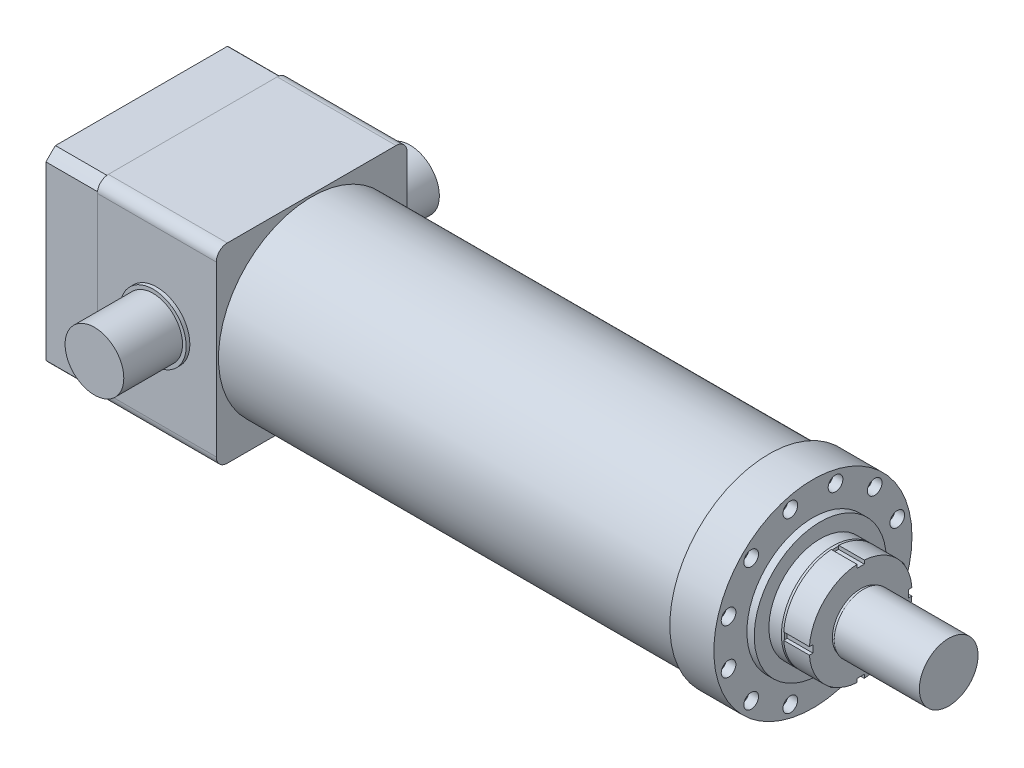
ISO-10303-21;
HEADER;
FILE_DESCRIPTION(('STEP AP214'),'2;1');
FILE_NAME('part.step','',(''),(''),'','','');
FILE_SCHEMA(('AUTOMOTIVE_DESIGN { 1 0 10303 214 1 1 1 1 }'));
ENDSEC;
DATA;
#1=APPLICATION_CONTEXT('core data for automotive mechanical design processes');
#2=APPLICATION_PROTOCOL_DEFINITION('international standard','automotive_design',2000,#1);
#3=PRODUCT_CONTEXT('',#1,'mechanical');
#4=PRODUCT('Part','Part','',(#3));
#5=PRODUCT_RELATED_PRODUCT_CATEGORY('part','',(#4));
#6=PRODUCT_DEFINITION_FORMATION('','',#4);
#7=PRODUCT_DEFINITION_CONTEXT('part definition',#1,'design');
#8=PRODUCT_DEFINITION('design','',#6,#7);
#9=PRODUCT_DEFINITION_SHAPE('','',#8);
#10=(LENGTH_UNIT() NAMED_UNIT(*) SI_UNIT(.MILLI.,.METRE.));
#11=(NAMED_UNIT(*) PLANE_ANGLE_UNIT() SI_UNIT($,.RADIAN.));
#12=(NAMED_UNIT(*) SI_UNIT($,.STERADIAN.) SOLID_ANGLE_UNIT());
#13=UNCERTAINTY_MEASURE_WITH_UNIT(LENGTH_MEASURE(1.E-05),#10,'distance_accuracy_value','');
#14=(GEOMETRIC_REPRESENTATION_CONTEXT(3) GLOBAL_UNCERTAINTY_ASSIGNED_CONTEXT((#13)) GLOBAL_UNIT_ASSIGNED_CONTEXT((#10,
#11,#12)) REPRESENTATION_CONTEXT('',''));
#15=CARTESIAN_POINT('',(0.,0.,0.));
#16=DIRECTION('',(0.,0.,1.));
#17=DIRECTION('',(1.,0.,0.));
#18=AXIS2_PLACEMENT_3D('',#15,#16,#17);
#19=CARTESIAN_POINT('',(-232.,0.,0.));
#20=DIRECTION('',(1.,0.,0.));
#21=DIRECTION('',(0.,0.,-1.));
#22=AXIS2_PLACEMENT_3D('',#19,#20,#21);
#23=CYLINDRICAL_SURFACE('',#22,175.);
#24=CARTESIAN_POINT('',(-162.,0.,0.));
#25=DIRECTION('',(-1.,0.,0.));
#26=DIRECTION('',(0.,0.,1.));
#27=AXIS2_PLACEMENT_3D('',#24,#25,#26);
#28=CIRCLE('',#27,175.);
#29=CARTESIAN_POINT('',(-162.,-117.1537451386,-130.));
#30=VERTEX_POINT('',#29);
#31=CARTESIAN_POINT('',(-162.,-130.,-117.1537451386));
#32=VERTEX_POINT('',#31);
#33=EDGE_CURVE('E146',#30,#32,#28,.T.);
#34=ORIENTED_EDGE('',*,*,#33,.T.);
#35=DIRECTION('',(1.,0.,0.));
#36=VECTOR('',#35,1.);
#37=CARTESIAN_POINT('',(-232.,-130.,-117.1537451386));
#38=LINE('',#37,#36);
#39=CARTESIAN_POINT('',(-232.,-130.,-117.1537451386));
#40=VERTEX_POINT('',#39);
#41=EDGE_CURVE('E12',#40,#32,#38,.T.);
#42=ORIENTED_EDGE('',*,*,#41,.F.);
#43=CARTESIAN_POINT('',(-232.,0.,0.));
#44=DIRECTION('',(-1.,0.,0.));
#45=DIRECTION('',(0.,0.,1.));
#46=AXIS2_PLACEMENT_3D('',#43,#44,#45);
#47=CIRCLE('',#46,175.);
#48=CARTESIAN_POINT('',(-232.,-117.1537451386,-130.));
#49=VERTEX_POINT('',#48);
#50=EDGE_CURVE('E161',#49,#40,#47,.T.);
#51=ORIENTED_EDGE('',*,*,#50,.F.);
#52=DIRECTION('',(1.,0.,0.));
#53=VECTOR('',#52,1.);
#54=CARTESIAN_POINT('',(-232.,-117.1537451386,-130.));
#55=LINE('',#54,#53);
#56=EDGE_CURVE('E142',#49,#30,#55,.T.);
#57=ORIENTED_EDGE('',*,*,#56,.T.);
#58=EDGE_LOOP('',(#34,#42,#51,#57));
#59=FACE_BOUND('',#58,.T.);
#60=ADVANCED_FACE('F50',(#59),#23,.T.);
#61=CARTESIAN_POINT('',(-232.,-130.,-117.1537451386));
#62=DIRECTION('',(0.,1.,0.));
#63=DIRECTION('',(0.,0.,1.));
#64=AXIS2_PLACEMENT_3D('',#61,#62,#63);
#65=PLANE('',#64);
#66=DIRECTION('',(0.,0.,1.));
#67=VECTOR('',#66,1.);
#68=CARTESIAN_POINT('',(-162.,-130.,-117.1537451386));
#69=LINE('',#68,#67);
#70=CARTESIAN_POINT('',(-162.,-130.,117.1537451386));
#71=VERTEX_POINT('',#70);
#72=EDGE_CURVE('E149',#32,#71,#69,.T.);
#73=ORIENTED_EDGE('',*,*,#72,.T.);
#74=DIRECTION('',(1.,0.,0.));
#75=VECTOR('',#74,1.);
#76=CARTESIAN_POINT('',(-232.,-130.,117.1537451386));
#77=LINE('',#76,#75);
#78=CARTESIAN_POINT('',(-232.,-130.,117.1537451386));
#79=VERTEX_POINT('',#78);
#80=EDGE_CURVE('E58',#79,#71,#77,.T.);
#81=ORIENTED_EDGE('',*,*,#80,.F.);
#82=DIRECTION('',(0.,0.,1.));
#83=VECTOR('',#82,1.);
#84=CARTESIAN_POINT('',(-232.,-130.,-117.1537451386));
#85=LINE('',#84,#83);
#86=EDGE_CURVE('E109',#40,#79,#85,.T.);
#87=ORIENTED_EDGE('',*,*,#86,.F.);
#88=ORIENTED_EDGE('',*,*,#41,.T.);
#89=EDGE_LOOP('',(#73,#81,#87,#88));
#90=FACE_BOUND('',#89,.T.);
#91=ADVANCED_FACE('F224',(#90),#65,.F.);
#92=CARTESIAN_POINT('',(-232.,0.,0.));
#93=DIRECTION('',(1.,0.,0.));
#94=DIRECTION('',(0.,0.,-1.));
#95=AXIS2_PLACEMENT_3D('',#92,#93,#94);
#96=CYLINDRICAL_SURFACE('',#95,175.);
#97=CARTESIAN_POINT('',(-162.,0.,0.));
#98=DIRECTION('',(-1.,0.,0.));
#99=DIRECTION('',(0.,0.,1.));
#100=AXIS2_PLACEMENT_3D('',#97,#98,#99);
#101=CIRCLE('',#100,175.);
#102=CARTESIAN_POINT('',(-162.,-117.1537451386,130.));
#103=VERTEX_POINT('',#102);
#104=EDGE_CURVE('E152',#71,#103,#101,.T.);
#105=ORIENTED_EDGE('',*,*,#104,.T.);
#106=DIRECTION('',(1.,0.,0.));
#107=VECTOR('',#106,1.);
#108=CARTESIAN_POINT('',(-232.,-117.1537451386,130.));
#109=LINE('',#108,#107);
#110=CARTESIAN_POINT('',(-232.,-117.1537451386,130.));
#111=VERTEX_POINT('',#110);
#112=EDGE_CURVE('E168',#111,#103,#109,.T.);
#113=ORIENTED_EDGE('',*,*,#112,.F.);
#114=CARTESIAN_POINT('',(-232.,0.,0.));
#115=DIRECTION('',(-1.,0.,0.));
#116=DIRECTION('',(0.,0.,1.));
#117=AXIS2_PLACEMENT_3D('',#114,#115,#116);
#118=CIRCLE('',#117,175.);
#119=EDGE_CURVE('E176',#79,#111,#118,.T.);
#120=ORIENTED_EDGE('',*,*,#119,.F.);
#121=ORIENTED_EDGE('',*,*,#80,.T.);
#122=EDGE_LOOP('',(#105,#113,#120,#121));
#123=FACE_BOUND('',#122,.T.);
#124=ADVANCED_FACE('F174',(#123),#96,.T.);
#125=CARTESIAN_POINT('',(-232.,117.1537451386,130.));
#126=DIRECTION('',(0.,0.,-1.));
#127=DIRECTION('',(-1.,0.,0.));
#128=AXIS2_PLACEMENT_3D('',#125,#126,#127);
#129=PLANE('',#128);
#130=DIRECTION('',(0.,1.,0.));
#131=VECTOR('',#130,1.);
#132=CARTESIAN_POINT('',(-162.,117.1537451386,130.));
#133=LINE('',#132,#131);
#134=CARTESIAN_POINT('',(-162.,117.1537451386,130.));
#135=VERTEX_POINT('',#134);
#136=EDGE_CURVE('E154',#103,#135,#133,.T.);
#137=ORIENTED_EDGE('',*,*,#136,.T.);
#138=DIRECTION('',(1.,0.,0.));
#139=VECTOR('',#138,1.);
#140=CARTESIAN_POINT('',(-232.,117.1537451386,130.));
#141=LINE('',#140,#139);
#142=CARTESIAN_POINT('',(-232.,117.1537451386,130.));
#143=VERTEX_POINT('',#142);
#144=EDGE_CURVE('E165',#143,#135,#141,.T.);
#145=ORIENTED_EDGE('',*,*,#144,.F.);
#146=DIRECTION('',(0.,1.,0.));
#147=VECTOR('',#146,1.);
#148=CARTESIAN_POINT('',(-232.,117.1537451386,130.));
#149=LINE('',#148,#147);
#150=EDGE_CURVE('E188',#111,#143,#149,.T.);
#151=ORIENTED_EDGE('',*,*,#150,.F.);
#152=ORIENTED_EDGE('',*,*,#112,.T.);
#153=EDGE_LOOP('',(#137,#145,#151,#152));
#154=FACE_BOUND('',#153,.T.);
#155=ADVANCED_FACE('F184',(#154),#129,.F.);
#156=CARTESIAN_POINT('',(-232.,0.,0.));
#157=DIRECTION('',(1.,0.,0.));
#158=DIRECTION('',(0.,0.,-1.));
#159=AXIS2_PLACEMENT_3D('',#156,#157,#158);
#160=CYLINDRICAL_SURFACE('',#159,175.);
#161=CARTESIAN_POINT('',(-162.,0.,0.));
#162=DIRECTION('',(-1.,0.,0.));
#163=DIRECTION('',(0.,0.,1.));
#164=AXIS2_PLACEMENT_3D('',#161,#162,#163);
#165=CIRCLE('',#164,175.);
#166=CARTESIAN_POINT('',(-162.,130.,117.1537451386));
#167=VERTEX_POINT('',#166);
#168=EDGE_CURVE('E156',#135,#167,#165,.T.);
#169=ORIENTED_EDGE('',*,*,#168,.T.);
#170=DIRECTION('',(1.,0.,0.));
#171=VECTOR('',#170,1.);
#172=CARTESIAN_POINT('',(-232.,130.,117.1537451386));
#173=LINE('',#172,#171);
#174=CARTESIAN_POINT('',(-232.,130.,117.1537451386));
#175=VERTEX_POINT('',#174);
#176=EDGE_CURVE('E137',#175,#167,#173,.T.);
#177=ORIENTED_EDGE('',*,*,#176,.F.);
#178=CARTESIAN_POINT('',(-232.,0.,0.));
#179=DIRECTION('',(-1.,0.,0.));
#180=DIRECTION('',(0.,0.,1.));
#181=AXIS2_PLACEMENT_3D('',#178,#179,#180);
#182=CIRCLE('',#181,175.);
#183=EDGE_CURVE('E128',#143,#175,#182,.T.);
#184=ORIENTED_EDGE('',*,*,#183,.F.);
#185=ORIENTED_EDGE('',*,*,#144,.T.);
#186=EDGE_LOOP('',(#169,#177,#184,#185));
#187=FACE_BOUND('',#186,.T.);
#188=ADVANCED_FACE('F187',(#187),#160,.T.);
#189=CARTESIAN_POINT('',(-232.,130.,-117.1537451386));
#190=DIRECTION('',(0.,-1.,0.));
#191=DIRECTION('',(0.,0.,-1.));
#192=AXIS2_PLACEMENT_3D('',#189,#190,#191);
#193=PLANE('',#192);
#194=DIRECTION('',(0.,0.,-1.));
#195=VECTOR('',#194,1.);
#196=CARTESIAN_POINT('',(-162.,130.,-117.1537451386));
#197=LINE('',#196,#195);
#198=CARTESIAN_POINT('',(-162.,130.,-117.1537451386));
#199=VERTEX_POINT('',#198);
#200=EDGE_CURVE('E136',#167,#199,#197,.T.);
#201=ORIENTED_EDGE('',*,*,#200,.T.);
#202=DIRECTION('',(1.,0.,0.));
#203=VECTOR('',#202,1.);
#204=CARTESIAN_POINT('',(-232.,130.,-117.1537451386));
#205=LINE('',#204,#203);
#206=CARTESIAN_POINT('',(-232.,130.,-117.1537451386));
#207=VERTEX_POINT('',#206);
#208=EDGE_CURVE('E133',#207,#199,#205,.T.);
#209=ORIENTED_EDGE('',*,*,#208,.F.);
#210=DIRECTION('',(0.,0.,-1.));
#211=VECTOR('',#210,1.);
#212=CARTESIAN_POINT('',(-232.,130.,-117.1537451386));
#213=LINE('',#212,#211);
#214=EDGE_CURVE('E122',#175,#207,#213,.T.);
#215=ORIENTED_EDGE('',*,*,#214,.F.);
#216=ORIENTED_EDGE('',*,*,#176,.T.);
#217=EDGE_LOOP('',(#201,#209,#215,#216));
#218=FACE_BOUND('',#217,.T.);
#219=ADVANCED_FACE('F134',(#218),#193,.F.);
#220=CARTESIAN_POINT('',(-232.,0.,0.));
#221=DIRECTION('',(1.,0.,0.));
#222=DIRECTION('',(0.,0.,-1.));
#223=AXIS2_PLACEMENT_3D('',#220,#221,#222);
#224=CYLINDRICAL_SURFACE('',#223,175.);
#225=CARTESIAN_POINT('',(-162.,0.,0.));
#226=DIRECTION('',(-1.,0.,0.));
#227=DIRECTION('',(0.,0.,1.));
#228=AXIS2_PLACEMENT_3D('',#225,#226,#227);
#229=CIRCLE('',#228,175.);
#230=CARTESIAN_POINT('',(-162.,117.1537451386,-130.));
#231=VERTEX_POINT('',#230);
#232=EDGE_CURVE('E95',#199,#231,#229,.T.);
#233=ORIENTED_EDGE('',*,*,#232,.T.);
#234=DIRECTION('',(1.,0.,0.));
#235=VECTOR('',#234,1.);
#236=CARTESIAN_POINT('',(-232.,117.1537451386,-130.));
#237=LINE('',#236,#235);
#238=CARTESIAN_POINT('',(-232.,117.1537451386,-130.));
#239=VERTEX_POINT('',#238);
#240=EDGE_CURVE('E138',#239,#231,#237,.T.);
#241=ORIENTED_EDGE('',*,*,#240,.F.);
#242=CARTESIAN_POINT('',(-232.,0.,0.));
#243=DIRECTION('',(-1.,0.,0.));
#244=DIRECTION('',(0.,0.,1.));
#245=AXIS2_PLACEMENT_3D('',#242,#243,#244);
#246=CIRCLE('',#245,175.);
#247=EDGE_CURVE('E126',#207,#239,#246,.T.);
#248=ORIENTED_EDGE('',*,*,#247,.F.);
#249=ORIENTED_EDGE('',*,*,#208,.T.);
#250=EDGE_LOOP('',(#233,#241,#248,#249));
#251=FACE_BOUND('',#250,.T.);
#252=ADVANCED_FACE('F140',(#251),#224,.T.);
#253=CARTESIAN_POINT('',(-232.,117.1537451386,-130.));
#254=DIRECTION('',(0.,0.,1.));
#255=DIRECTION('',(0.,-1.,0.));
#256=AXIS2_PLACEMENT_3D('',#253,#254,#255);
#257=PLANE('',#256);
#258=DIRECTION('',(0.,-1.,0.));
#259=VECTOR('',#258,1.);
#260=CARTESIAN_POINT('',(-162.,117.1537451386,-130.));
#261=LINE('',#260,#259);
#262=EDGE_CURVE('E101',#231,#30,#261,.T.);
#263=ORIENTED_EDGE('',*,*,#262,.T.);
#264=ORIENTED_EDGE('',*,*,#56,.F.);
#265=DIRECTION('',(0.,-1.,0.));
#266=VECTOR('',#265,1.);
#267=CARTESIAN_POINT('',(-232.,117.1537451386,-130.));
#268=LINE('',#267,#266);
#269=EDGE_CURVE('E66',#239,#49,#268,.T.);
#270=ORIENTED_EDGE('',*,*,#269,.F.);
#271=ORIENTED_EDGE('',*,*,#240,.T.);
#272=EDGE_LOOP('',(#263,#264,#270,#271));
#273=FACE_BOUND('',#272,.T.);
#274=ADVANCED_FACE('F231',(#273),#257,.F.);
#275=CARTESIAN_POINT('',(-232.,0.,0.));
#276=DIRECTION('',(-1.,0.,0.));
#277=DIRECTION('',(0.,0.,1.));
#278=AXIS2_PLACEMENT_3D('',#275,#276,#277);
#279=PLANE('',#278);
#280=CARTESIAN_POINT('',(-232.,0.,0.));
#281=DIRECTION('',(-1.,0.,0.));
#282=DIRECTION('',(0.,0.,1.));
#283=AXIS2_PLACEMENT_3D('',#280,#281,#282);
#284=CIRCLE('',#283,80.);
#285=CARTESIAN_POINT('',(-232.,0.,80.));
#286=VERTEX_POINT('',#285);
#287=EDGE_CURVE('E150',#286,#286,#284,.T.);
#288=ORIENTED_EDGE('',*,*,#287,.F.);
#289=EDGE_LOOP('',(#288));
#290=FACE_BOUND('',#289,.T.);
#291=ORIENTED_EDGE('',*,*,#50,.T.);
#292=ORIENTED_EDGE('',*,*,#86,.T.);
#293=ORIENTED_EDGE('',*,*,#119,.T.);
#294=ORIENTED_EDGE('',*,*,#150,.T.);
#295=ORIENTED_EDGE('',*,*,#183,.T.);
#296=ORIENTED_EDGE('',*,*,#214,.T.);
#297=ORIENTED_EDGE('',*,*,#247,.T.);
#298=ORIENTED_EDGE('',*,*,#269,.T.);
#299=EDGE_LOOP('',(#291,#292,#293,#294,#295,#296,#297,#298));
#300=FACE_BOUND('',#299,.T.);
#301=ADVANCED_FACE('F124',(#290,#300),#279,.T.);
#302=CARTESIAN_POINT('',(-162.,0.,0.));
#303=DIRECTION('',(-1.,0.,0.));
#304=DIRECTION('',(0.,0.,1.));
#305=AXIS2_PLACEMENT_3D('',#302,#303,#304);
#306=PLANE('',#305);
#307=ORIENTED_EDGE('',*,*,#33,.F.);
#308=ORIENTED_EDGE('',*,*,#262,.F.);
#309=ORIENTED_EDGE('',*,*,#232,.F.);
#310=ORIENTED_EDGE('',*,*,#200,.F.);
#311=ORIENTED_EDGE('',*,*,#168,.F.);
#312=ORIENTED_EDGE('',*,*,#136,.F.);
#313=ORIENTED_EDGE('',*,*,#104,.F.);
#314=ORIENTED_EDGE('',*,*,#72,.F.);
#315=EDGE_LOOP('',(#307,#308,#309,#310,#311,#312,#313,#314));
#316=FACE_BOUND('',#315,.T.);
#317=ADVANCED_FACE('F180',(#316),#306,.F.);
#318=CARTESIAN_POINT('',(-206.,0.,0.));
#319=DIRECTION('',(-1.,0.,0.));
#320=DIRECTION('',(0.,0.,1.));
#321=AXIS2_PLACEMENT_3D('',#318,#319,#320);
#322=CYLINDRICAL_SURFACE('',#321,80.);
#323=CARTESIAN_POINT('',(-206.,0.,0.));
#324=DIRECTION('',(-1.,0.,0.));
#325=DIRECTION('',(0.,0.,1.));
#326=AXIS2_PLACEMENT_3D('',#323,#324,#325);
#327=CIRCLE('',#326,80.);
#328=CARTESIAN_POINT('',(-206.,0.,80.));
#329=VERTEX_POINT('',#328);
#330=EDGE_CURVE('E196',#329,#329,#327,.T.);
#331=CARTESIAN_POINT('',(-206.,0.,80.));
#332=CARTESIAN_POINT('',(-206.270833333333,0.,80.));
#333=CARTESIAN_POINT('',(-206.541666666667,0.,80.));
#334=CARTESIAN_POINT('',(-207.083333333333,0.,80.));
#335=CARTESIAN_POINT('',(-207.354166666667,0.,80.));
#336=CARTESIAN_POINT('',(-207.895833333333,0.,80.));
#337=CARTESIAN_POINT('',(-208.166666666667,0.,80.));
#338=CARTESIAN_POINT('',(-208.708333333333,0.,80.));
#339=CARTESIAN_POINT('',(-208.979166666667,0.,80.));
#340=CARTESIAN_POINT('',(-209.520833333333,0.,80.));
#341=CARTESIAN_POINT('',(-209.791666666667,0.,80.));
#342=CARTESIAN_POINT('',(-210.333333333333,0.,80.));
#343=CARTESIAN_POINT('',(-210.604166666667,0.,80.));
#344=CARTESIAN_POINT('',(-211.145833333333,0.,80.));
#345=CARTESIAN_POINT('',(-211.416666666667,0.,80.));
#346=CARTESIAN_POINT('',(-211.958333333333,0.,80.));
#347=CARTESIAN_POINT('',(-212.229166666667,0.,80.));
#348=CARTESIAN_POINT('',(-212.770833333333,0.,80.));
#349=CARTESIAN_POINT('',(-213.041666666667,0.,80.));
#350=CARTESIAN_POINT('',(-213.583333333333,0.,80.));
#351=CARTESIAN_POINT('',(-213.854166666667,0.,80.));
#352=CARTESIAN_POINT('',(-214.395833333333,0.,80.));
#353=CARTESIAN_POINT('',(-214.666666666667,0.,80.));
#354=CARTESIAN_POINT('',(-215.208333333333,0.,80.));
#355=CARTESIAN_POINT('',(-215.479166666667,0.,80.));
#356=CARTESIAN_POINT('',(-216.020833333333,0.,80.));
#357=CARTESIAN_POINT('',(-216.291666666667,0.,80.));
#358=CARTESIAN_POINT('',(-216.833333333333,0.,80.));
#359=CARTESIAN_POINT('',(-217.104166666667,0.,80.));
#360=CARTESIAN_POINT('',(-217.645833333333,0.,80.));
#361=CARTESIAN_POINT('',(-217.916666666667,0.,80.));
#362=CARTESIAN_POINT('',(-218.458333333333,0.,80.));
#363=CARTESIAN_POINT('',(-218.729166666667,0.,80.));
#364=CARTESIAN_POINT('',(-219.270833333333,0.,80.));
#365=CARTESIAN_POINT('',(-219.541666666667,0.,80.));
#366=CARTESIAN_POINT('',(-220.083333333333,0.,80.));
#367=CARTESIAN_POINT('',(-220.354166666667,0.,80.));
#368=CARTESIAN_POINT('',(-220.895833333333,0.,80.));
#369=CARTESIAN_POINT('',(-221.166666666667,0.,80.));
#370=CARTESIAN_POINT('',(-221.708333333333,0.,80.));
#371=CARTESIAN_POINT('',(-221.979166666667,0.,80.));
#372=CARTESIAN_POINT('',(-222.520833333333,0.,80.));
#373=CARTESIAN_POINT('',(-222.791666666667,0.,80.));
#374=CARTESIAN_POINT('',(-223.333333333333,0.,80.));
#375=CARTESIAN_POINT('',(-223.604166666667,0.,80.));
#376=CARTESIAN_POINT('',(-224.145833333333,0.,80.));
#377=CARTESIAN_POINT('',(-224.416666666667,0.,80.));
#378=CARTESIAN_POINT('',(-224.958333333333,0.,80.));
#379=CARTESIAN_POINT('',(-225.229166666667,0.,80.));
#380=CARTESIAN_POINT('',(-225.770833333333,0.,80.));
#381=CARTESIAN_POINT('',(-226.041666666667,0.,80.));
#382=CARTESIAN_POINT('',(-226.583333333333,0.,80.));
#383=CARTESIAN_POINT('',(-226.854166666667,0.,80.));
#384=CARTESIAN_POINT('',(-227.395833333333,0.,80.));
#385=CARTESIAN_POINT('',(-227.666666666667,0.,80.));
#386=CARTESIAN_POINT('',(-228.208333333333,0.,80.));
#387=CARTESIAN_POINT('',(-228.479166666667,0.,80.));
#388=CARTESIAN_POINT('',(-229.020833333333,0.,80.));
#389=CARTESIAN_POINT('',(-229.291666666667,0.,80.));
#390=CARTESIAN_POINT('',(-229.833333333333,0.,80.));
#391=CARTESIAN_POINT('',(-230.104166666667,0.,80.));
#392=CARTESIAN_POINT('',(-230.645833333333,0.,80.));
#393=CARTESIAN_POINT('',(-230.916666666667,0.,80.));
#394=CARTESIAN_POINT('',(-231.458333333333,0.,80.));
#395=CARTESIAN_POINT('',(-231.729166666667,0.,80.));
#396=CARTESIAN_POINT('',(-232.,0.,80.));
#397=B_SPLINE_CURVE_WITH_KNOTS('',3,(#331,#332,#333,#334,#335,#336,#337,#338,#339,#340,#341,
#342,#343,#344,#345,#346,#347,#348,#349,#350,#351,#352,#353,#354,#355,#356,#357,#358,#359,#360,
#361,#362,#363,#364,#365,#366,#367,#368,#369,#370,#371,#372,#373,#374,#375,#376,#377,#378,#379,
#380,#381,#382,#383,#384,#385,#386,#387,#388,#389,#390,#391,#392,#393,#394,#395,#396),
.UNSPECIFIED.,.F.,.F.,(4,2,2,2,2,2,2,2,2,2,2,2,2,2,2,2,2,2,2,2,2,2,2,2,2,2,2,2,2,2,2,2,4),(0.,
0.812499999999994,1.62499999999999,2.43749999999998,3.24999999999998,4.0625,4.87499999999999,
5.68749999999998,6.49999999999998,7.3125,8.12499999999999,8.93749999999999,9.74999999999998,
10.5625,11.375,12.1875,13.,13.8125,14.625,15.4375,16.25,17.0625,17.875,18.6875,19.5,20.3125,
21.125,21.9375,22.75,23.5625,24.375,25.1875,26.),.UNSPECIFIED.);
#398=EDGE_CURVE('BSEAM211',#329,#286,#397,.T.);
#399=ORIENTED_EDGE('',*,*,#330,.F.);
#400=ORIENTED_EDGE('',*,*,#287,.T.);
#401=ORIENTED_EDGE('',*,*,#398,.T.);
#402=ORIENTED_EDGE('',*,*,#398,.F.);
#403=EDGE_LOOP('',(#399,#401,#400,#402));
#404=FACE_BOUND('',#403,.T.);
#405=ADVANCED_FACE('F211',(#404),#322,.F.);
#406=CARTESIAN_POINT('',(-168.,0.,0.));
#407=DIRECTION('',(-1.,0.,0.));
#408=DIRECTION('',(0.,0.,1.));
#409=AXIS2_PLACEMENT_3D('',#406,#407,#408);
#410=CYLINDRICAL_SURFACE('',#409,81.5);
#411=CARTESIAN_POINT('',(-168.,0.,0.));
#412=DIRECTION('',(-1.,0.,0.));
#413=DIRECTION('',(0.,0.,1.));
#414=AXIS2_PLACEMENT_3D('',#411,#412,#413);
#415=CIRCLE('',#414,81.5);
#416=CARTESIAN_POINT('',(-168.,0.,81.5));
#417=VERTEX_POINT('',#416);
#418=EDGE_CURVE('E199',#417,#417,#415,.T.);
#419=ORIENTED_EDGE('',*,*,#418,.F.);
#420=EDGE_LOOP('',(#419));
#421=FACE_BOUND('',#420,.T.);
#422=CARTESIAN_POINT('',(-206.,0.,0.));
#423=DIRECTION('',(-1.,0.,0.));
#424=DIRECTION('',(0.,0.,1.));
#425=AXIS2_PLACEMENT_3D('',#422,#423,#424);
#426=CIRCLE('',#425,81.5);
#427=CARTESIAN_POINT('',(-206.,0.,81.5));
#428=VERTEX_POINT('',#427);
#429=EDGE_CURVE('E200',#428,#428,#426,.T.);
#430=ORIENTED_EDGE('',*,*,#429,.T.);
#431=EDGE_LOOP('',(#430));
#432=FACE_BOUND('',#431,.T.);
#433=ADVANCED_FACE('F208',(#421,#432),#410,.F.);
#434=CARTESIAN_POINT('',(-168.,0.,0.));
#435=DIRECTION('',(-1.,0.,0.));
#436=DIRECTION('',(0.,0.,1.));
#437=AXIS2_PLACEMENT_3D('',#434,#435,#436);
#438=PLANE('',#437);
#439=ORIENTED_EDGE('',*,*,#418,.T.);
#440=EDGE_LOOP('',(#439));
#441=FACE_BOUND('',#440,.T.);
#442=ADVANCED_FACE('F206',(#441),#438,.T.);
#443=CARTESIAN_POINT('',(-206.,0.,0.));
#444=DIRECTION('',(-1.,0.,0.));
#445=DIRECTION('',(0.,0.,1.));
#446=AXIS2_PLACEMENT_3D('',#443,#444,#445);
#447=PLANE('',#446);
#448=ORIENTED_EDGE('',*,*,#330,.T.);
#449=EDGE_LOOP('',(#448));
#450=FACE_BOUND('',#449,.T.);
#451=ORIENTED_EDGE('',*,*,#429,.F.);
#452=EDGE_LOOP('',(#451));
#453=FACE_BOUND('',#452,.T.);
#454=ADVANCED_FACE('F215',(#450,#453),#447,.F.);
#455=CLOSED_SHELL('',(#60,#91,#124,#155,#188,#219,#252,#274,#301,#317,#405,#433,#442,#454));
#456=MANIFOLD_SOLID_BREP('B2',#455);
#457=CARTESIAN_POINT('',(-162.,115.,130.));
#458=DIRECTION('',(0.,0.,-1.));
#459=DIRECTION('',(0.,1.,0.));
#460=AXIS2_PLACEMENT_3D('',#457,#458,#459);
#461=PLANE('',#460);
#462=DIRECTION('',(0.,1.,0.));
#463=VECTOR('',#462,1.);
#464=CARTESIAN_POINT('',(0.,115.,130.));
#465=LINE('',#464,#463);
#466=CARTESIAN_POINT('',(0.,-115.,130.));
#467=VERTEX_POINT('',#466);
#468=CARTESIAN_POINT('',(0.,115.,130.));
#469=VERTEX_POINT('',#468);
#470=EDGE_CURVE('E401',#467,#469,#465,.T.);
#471=ORIENTED_EDGE('',*,*,#470,.T.);
#472=DIRECTION('',(1.,0.,0.));
#473=VECTOR('',#472,1.);
#474=CARTESIAN_POINT('',(-162.,115.,130.));
#475=LINE('',#474,#473);
#476=CARTESIAN_POINT('',(-162.,115.,130.));
#477=VERTEX_POINT('',#476);
#478=EDGE_CURVE('E447',#477,#469,#475,.T.);
#479=ORIENTED_EDGE('',*,*,#478,.F.);
#480=DIRECTION('',(0.,1.,0.));
#481=VECTOR('',#480,1.);
#482=CARTESIAN_POINT('',(-162.,115.,130.));
#483=LINE('',#482,#481);
#484=CARTESIAN_POINT('',(-162.,-115.,130.));
#485=VERTEX_POINT('',#484);
#486=EDGE_CURVE('E366',#485,#477,#483,.T.);
#487=ORIENTED_EDGE('',*,*,#486,.F.);
#488=DIRECTION('',(1.,0.,0.));
#489=VECTOR('',#488,1.);
#490=CARTESIAN_POINT('',(-162.,-115.,130.));
#491=LINE('',#490,#489);
#492=EDGE_CURVE('E441',#485,#467,#491,.T.);
#493=ORIENTED_EDGE('',*,*,#492,.T.);
#494=EDGE_LOOP('',(#471,#479,#487,#493));
#495=FACE_BOUND('',#494,.T.);
#496=CARTESIAN_POINT('',(-81.,0.,130.));
#497=DIRECTION('',(0.,0.,-1.));
#498=DIRECTION('',(0.,1.,0.));
#499=AXIS2_PLACEMENT_3D('',#496,#497,#498);
#500=CIRCLE('',#499,45.);
#501=CARTESIAN_POINT('',(-81.,45.,130.));
#502=VERTEX_POINT('',#501);
#503=EDGE_CURVE('E48',#502,#502,#500,.F.);
#504=ORIENTED_EDGE('',*,*,#503,.F.);
#505=EDGE_LOOP('',(#504));
#506=FACE_BOUND('',#505,.T.);
#507=ADVANCED_FACE('F348',(#495,#506),#461,.F.);
#508=CARTESIAN_POINT('',(-162.,115.,115.));
#509=DIRECTION('',(1.,0.,0.));
#510=DIRECTION('',(0.,0.,-1.));
#511=AXIS2_PLACEMENT_3D('',#508,#509,#510);
#512=CYLINDRICAL_SURFACE('',#511,15.);
#513=CARTESIAN_POINT('',(0.,115.,115.));
#514=DIRECTION('',(-1.,0.,0.));
#515=DIRECTION('',(0.,0.,1.));
#516=AXIS2_PLACEMENT_3D('',#513,#514,#515);
#517=CIRCLE('',#516,15.);
#518=CARTESIAN_POINT('',(0.,130.,115.));
#519=VERTEX_POINT('',#518);
#520=EDGE_CURVE('E451',#469,#519,#517,.T.);
#521=ORIENTED_EDGE('',*,*,#520,.T.);
#522=DIRECTION('',(1.,0.,0.));
#523=VECTOR('',#522,1.);
#524=CARTESIAN_POINT('',(-162.,130.,115.));
#525=LINE('',#524,#523);
#526=CARTESIAN_POINT('',(-162.,130.,115.));
#527=VERTEX_POINT('',#526);
#528=EDGE_CURVE('E358',#527,#519,#525,.T.);
#529=ORIENTED_EDGE('',*,*,#528,.F.);
#530=CARTESIAN_POINT('',(-162.,115.,115.));
#531=DIRECTION('',(-1.,0.,0.));
#532=DIRECTION('',(0.,0.,1.));
#533=AXIS2_PLACEMENT_3D('',#530,#531,#532);
#534=CIRCLE('',#533,15.);
#535=EDGE_CURVE('E474',#477,#527,#534,.T.);
#536=ORIENTED_EDGE('',*,*,#535,.F.);
#537=ORIENTED_EDGE('',*,*,#478,.T.);
#538=EDGE_LOOP('',(#521,#529,#536,#537));
#539=FACE_BOUND('',#538,.T.);
#540=ADVANCED_FACE('F350',(#539),#512,.T.);
#541=CARTESIAN_POINT('',(-162.,130.,-115.));
#542=DIRECTION('',(0.,-1.,0.));
#543=DIRECTION('',(0.,0.,-1.));
#544=AXIS2_PLACEMENT_3D('',#541,#542,#543);
#545=PLANE('',#544);
#546=DIRECTION('',(0.,0.,-1.));
#547=VECTOR('',#546,1.);
#548=CARTESIAN_POINT('',(0.,130.,-115.));
#549=LINE('',#548,#547);
#550=CARTESIAN_POINT('',(0.,130.,-115.));
#551=VERTEX_POINT('',#550);
#552=EDGE_CURVE('E455',#519,#551,#549,.T.);
#553=ORIENTED_EDGE('',*,*,#552,.T.);
#554=DIRECTION('',(1.,0.,0.));
#555=VECTOR('',#554,1.);
#556=CARTESIAN_POINT('',(-162.,130.,-115.));
#557=LINE('',#556,#555);
#558=CARTESIAN_POINT('',(-162.,130.,-115.));
#559=VERTEX_POINT('',#558);
#560=EDGE_CURVE('E489',#559,#551,#557,.T.);
#561=ORIENTED_EDGE('',*,*,#560,.F.);
#562=DIRECTION('',(0.,0.,-1.));
#563=VECTOR('',#562,1.);
#564=CARTESIAN_POINT('',(-162.,130.,-115.));
#565=LINE('',#564,#563);
#566=EDGE_CURVE('E410',#527,#559,#565,.T.);
#567=ORIENTED_EDGE('',*,*,#566,.F.);
#568=ORIENTED_EDGE('',*,*,#528,.T.);
#569=EDGE_LOOP('',(#553,#561,#567,#568));
#570=FACE_BOUND('',#569,.T.);
#571=ADVANCED_FACE('F494',(#570),#545,.F.);
#572=CARTESIAN_POINT('',(-162.,115.,-115.));
#573=DIRECTION('',(1.,0.,0.));
#574=DIRECTION('',(0.,0.,-1.));
#575=AXIS2_PLACEMENT_3D('',#572,#573,#574);
#576=CYLINDRICAL_SURFACE('',#575,15.);
#577=CARTESIAN_POINT('',(0.,115.,-115.));
#578=DIRECTION('',(-1.,0.,0.));
#579=DIRECTION('',(0.,0.,-1.));
#580=AXIS2_PLACEMENT_3D('',#577,#578,#579);
#581=CIRCLE('',#580,15.);
#582=CARTESIAN_POINT('',(0.,115.,-130.));
#583=VERTEX_POINT('',#582);
#584=EDGE_CURVE('E459',#551,#583,#581,.T.);
#585=ORIENTED_EDGE('',*,*,#584,.T.);
#586=DIRECTION('',(1.,0.,0.));
#587=VECTOR('',#586,1.);
#588=CARTESIAN_POINT('',(-162.,115.,-130.));
#589=LINE('',#588,#587);
#590=CARTESIAN_POINT('',(-162.,115.,-130.));
#591=VERTEX_POINT('',#590);
#592=EDGE_CURVE('E485',#591,#583,#589,.T.);
#593=ORIENTED_EDGE('',*,*,#592,.F.);
#594=CARTESIAN_POINT('',(-162.,115.,-115.));
#595=DIRECTION('',(-1.,0.,0.));
#596=DIRECTION('',(0.,0.,-1.));
#597=AXIS2_PLACEMENT_3D('',#594,#595,#596);
#598=CIRCLE('',#597,15.);
#599=EDGE_CURVE('E513',#559,#591,#598,.T.);
#600=ORIENTED_EDGE('',*,*,#599,.F.);
#601=ORIENTED_EDGE('',*,*,#560,.T.);
#602=EDGE_LOOP('',(#585,#593,#600,#601));
#603=FACE_BOUND('',#602,.T.);
#604=ADVANCED_FACE('F505',(#603),#576,.T.);
#605=CARTESIAN_POINT('',(-162.,115.,-130.));
#606=DIRECTION('',(0.,0.,1.));
#607=DIRECTION('',(0.,-1.,0.));
#608=AXIS2_PLACEMENT_3D('',#605,#606,#607);
#609=PLANE('',#608);
#610=CARTESIAN_POINT('',(-81.,0.,-130.));
#611=DIRECTION('',(0.,0.,1.));
#612=DIRECTION('',(1.,0.,0.));
#613=AXIS2_PLACEMENT_3D('',#610,#611,#612);
#614=CIRCLE('',#613,45.);
#615=CARTESIAN_POINT('',(-36.,0.,-130.));
#616=VERTEX_POINT('',#615);
#617=EDGE_CURVE('E539',#616,#616,#614,.T.);
#618=ORIENTED_EDGE('',*,*,#617,.T.);
#619=EDGE_LOOP('',(#618));
#620=FACE_BOUND('',#619,.T.);
#621=DIRECTION('',(0.,-1.,0.));
#622=VECTOR('',#621,1.);
#623=CARTESIAN_POINT('',(0.,115.,-130.));
#624=LINE('',#623,#622);
#625=CARTESIAN_POINT('',(0.,-115.,-130.));
#626=VERTEX_POINT('',#625);
#627=EDGE_CURVE('E462',#583,#626,#624,.T.);
#628=ORIENTED_EDGE('',*,*,#627,.T.);
#629=DIRECTION('',(1.,0.,0.));
#630=VECTOR('',#629,1.);
#631=CARTESIAN_POINT('',(-162.,-115.,-130.));
#632=LINE('',#631,#630);
#633=CARTESIAN_POINT('',(-162.,-115.,-130.));
#634=VERTEX_POINT('',#633);
#635=EDGE_CURVE('E481',#634,#626,#632,.T.);
#636=ORIENTED_EDGE('',*,*,#635,.F.);
#637=DIRECTION('',(0.,-1.,0.));
#638=VECTOR('',#637,1.);
#639=CARTESIAN_POINT('',(-162.,115.,-130.));
#640=LINE('',#639,#638);
#641=EDGE_CURVE('E511',#591,#634,#640,.T.);
#642=ORIENTED_EDGE('',*,*,#641,.F.);
#643=ORIENTED_EDGE('',*,*,#592,.T.);
#644=EDGE_LOOP('',(#628,#636,#642,#643));
#645=FACE_BOUND('',#644,.T.);
#646=ADVANCED_FACE('F509',(#620,#645),#609,.F.);
#647=CARTESIAN_POINT('',(-162.,-115.,-115.));
#648=DIRECTION('',(1.,0.,0.));
#649=DIRECTION('',(0.,0.,-1.));
#650=AXIS2_PLACEMENT_3D('',#647,#648,#649);
#651=CYLINDRICAL_SURFACE('',#650,15.);
#652=CARTESIAN_POINT('',(0.,-115.,-115.));
#653=DIRECTION('',(-1.,0.,0.));
#654=DIRECTION('',(0.,0.,1.));
#655=AXIS2_PLACEMENT_3D('',#652,#653,#654);
#656=CIRCLE('',#655,15.);
#657=CARTESIAN_POINT('',(0.,-130.,-115.));
#658=VERTEX_POINT('',#657);
#659=EDGE_CURVE('E465',#626,#658,#656,.T.);
#660=ORIENTED_EDGE('',*,*,#659,.T.);
#661=DIRECTION('',(1.,0.,0.));
#662=VECTOR('',#661,1.);
#663=CARTESIAN_POINT('',(-162.,-130.,-115.));
#664=LINE('',#663,#662);
#665=CARTESIAN_POINT('',(-162.,-130.,-115.));
#666=VERTEX_POINT('',#665);
#667=EDGE_CURVE('E440',#666,#658,#664,.T.);
#668=ORIENTED_EDGE('',*,*,#667,.F.);
#669=CARTESIAN_POINT('',(-162.,-115.,-115.));
#670=DIRECTION('',(-1.,0.,0.));
#671=DIRECTION('',(0.,0.,1.));
#672=AXIS2_PLACEMENT_3D('',#669,#670,#671);
#673=CIRCLE('',#672,15.);
#674=EDGE_CURVE('E429',#634,#666,#673,.T.);
#675=ORIENTED_EDGE('',*,*,#674,.F.);
#676=ORIENTED_EDGE('',*,*,#635,.T.);
#677=EDGE_LOOP('',(#660,#668,#675,#676));
#678=FACE_BOUND('',#677,.T.);
#679=ADVANCED_FACE('F578',(#678),#651,.T.);
#680=CARTESIAN_POINT('',(-162.,-130.,-115.));
#681=DIRECTION('',(0.,1.,0.));
#682=DIRECTION('',(0.,0.,1.));
#683=AXIS2_PLACEMENT_3D('',#680,#681,#682);
#684=PLANE('',#683);
#685=DIRECTION('',(0.,0.,1.));
#686=VECTOR('',#685,1.);
#687=CARTESIAN_POINT('',(0.,-130.,-115.));
#688=LINE('',#687,#686);
#689=CARTESIAN_POINT('',(0.,-130.,115.));
#690=VERTEX_POINT('',#689);
#691=EDGE_CURVE('E438',#658,#690,#688,.T.);
#692=ORIENTED_EDGE('',*,*,#691,.T.);
#693=DIRECTION('',(1.,0.,0.));
#694=VECTOR('',#693,1.);
#695=CARTESIAN_POINT('',(-162.,-130.,115.));
#696=LINE('',#695,#694);
#697=CARTESIAN_POINT('',(-162.,-130.,115.));
#698=VERTEX_POINT('',#697);
#699=EDGE_CURVE('E435',#698,#690,#696,.T.);
#700=ORIENTED_EDGE('',*,*,#699,.F.);
#701=DIRECTION('',(0.,0.,1.));
#702=VECTOR('',#701,1.);
#703=CARTESIAN_POINT('',(-162.,-130.,-115.));
#704=LINE('',#703,#702);
#705=EDGE_CURVE('E423',#666,#698,#704,.T.);
#706=ORIENTED_EDGE('',*,*,#705,.F.);
#707=ORIENTED_EDGE('',*,*,#667,.T.);
#708=EDGE_LOOP('',(#692,#700,#706,#707));
#709=FACE_BOUND('',#708,.T.);
#710=ADVANCED_FACE('F436',(#709),#684,.F.);
#711=CARTESIAN_POINT('',(-162.,-115.,115.));
#712=DIRECTION('',(1.,0.,0.));
#713=DIRECTION('',(0.,0.,-1.));
#714=AXIS2_PLACEMENT_3D('',#711,#712,#713);
#715=CYLINDRICAL_SURFACE('',#714,15.);
#716=CARTESIAN_POINT('',(0.,-115.,115.));
#717=DIRECTION('',(-1.,0.,0.));
#718=DIRECTION('',(0.,0.,-1.));
#719=AXIS2_PLACEMENT_3D('',#716,#717,#718);
#720=CIRCLE('',#719,15.);
#721=EDGE_CURVE('E395',#690,#467,#720,.T.);
#722=ORIENTED_EDGE('',*,*,#721,.T.);
#723=ORIENTED_EDGE('',*,*,#492,.F.);
#724=CARTESIAN_POINT('',(-162.,-115.,115.));
#725=DIRECTION('',(-1.,0.,0.));
#726=DIRECTION('',(0.,0.,-1.));
#727=AXIS2_PLACEMENT_3D('',#724,#725,#726);
#728=CIRCLE('',#727,15.);
#729=EDGE_CURVE('E427',#698,#485,#728,.T.);
#730=ORIENTED_EDGE('',*,*,#729,.F.);
#731=ORIENTED_EDGE('',*,*,#699,.T.);
#732=EDGE_LOOP('',(#722,#723,#730,#731));
#733=FACE_BOUND('',#732,.T.);
#734=ADVANCED_FACE('F443',(#733),#715,.T.);
#735=CARTESIAN_POINT('',(-162.,115.,115.));
#736=DIRECTION('',(-1.,0.,0.));
#737=DIRECTION('',(0.,0.,1.));
#738=AXIS2_PLACEMENT_3D('',#735,#736,#737);
#739=PLANE('',#738);
#740=ORIENTED_EDGE('',*,*,#535,.T.);
#741=ORIENTED_EDGE('',*,*,#566,.T.);
#742=ORIENTED_EDGE('',*,*,#599,.T.);
#743=ORIENTED_EDGE('',*,*,#641,.T.);
#744=ORIENTED_EDGE('',*,*,#674,.T.);
#745=ORIENTED_EDGE('',*,*,#705,.T.);
#746=ORIENTED_EDGE('',*,*,#729,.T.);
#747=ORIENTED_EDGE('',*,*,#486,.T.);
#748=EDGE_LOOP('',(#740,#741,#742,#743,#744,#745,#746,#747));
#749=FACE_BOUND('',#748,.T.);
#750=ADVANCED_FACE('F425',(#749),#739,.T.);
#751=CARTESIAN_POINT('',(0.,115.,115.));
#752=DIRECTION('',(-1.,0.,0.));
#753=DIRECTION('',(0.,0.,1.));
#754=AXIS2_PLACEMENT_3D('',#751,#752,#753);
#755=PLANE('',#754);
#756=ORIENTED_EDGE('',*,*,#520,.F.);
#757=ORIENTED_EDGE('',*,*,#470,.F.);
#758=ORIENTED_EDGE('',*,*,#721,.F.);
#759=ORIENTED_EDGE('',*,*,#691,.F.);
#760=ORIENTED_EDGE('',*,*,#659,.F.);
#761=ORIENTED_EDGE('',*,*,#627,.F.);
#762=ORIENTED_EDGE('',*,*,#584,.F.);
#763=ORIENTED_EDGE('',*,*,#552,.F.);
#764=EDGE_LOOP('',(#756,#757,#758,#759,#760,#761,#762,#763));
#765=FACE_BOUND('',#764,.T.);
#766=ADVANCED_FACE('F499',(#765),#755,.F.);
#767=CARTESIAN_POINT('',(-81.,0.,135.));
#768=DIRECTION('',(0.,0.,1.));
#769=DIRECTION('',(1.,0.,0.));
#770=AXIS2_PLACEMENT_3D('',#767,#768,#769);
#771=PLANE('',#770);
#772=CARTESIAN_POINT('',(-81.,0.,135.));
#773=DIRECTION('',(0.,0.,1.));
#774=DIRECTION('',(1.,0.,0.));
#775=AXIS2_PLACEMENT_3D('',#772,#773,#774);
#776=CIRCLE('',#775,45.);
#777=CARTESIAN_POINT('',(-36.,0.,135.));
#778=VERTEX_POINT('',#777);
#779=EDGE_CURVE('E530',#778,#778,#776,.T.);
#780=ORIENTED_EDGE('',*,*,#779,.T.);
#781=EDGE_LOOP('',(#780));
#782=FACE_BOUND('',#781,.T.);
#783=CARTESIAN_POINT('',(-81.,0.,135.));
#784=DIRECTION('',(0.,0.,1.));
#785=DIRECTION('',(1.,0.,0.));
#786=AXIS2_PLACEMENT_3D('',#783,#784,#785);
#787=CIRCLE('',#786,40.);
#788=CARTESIAN_POINT('',(-41.,0.,135.));
#789=VERTEX_POINT('',#788);
#790=EDGE_CURVE('E534',#789,#789,#787,.T.);
#791=ORIENTED_EDGE('',*,*,#790,.F.);
#792=EDGE_LOOP('',(#791));
#793=FACE_BOUND('',#792,.T.);
#794=ADVANCED_FACE('F624',(#782,#793),#771,.T.);
#795=CARTESIAN_POINT('',(-81.,0.,135.));
#796=DIRECTION('',(0.,0.,-1.));
#797=DIRECTION('',(-1.,0.,0.));
#798=AXIS2_PLACEMENT_3D('',#795,#796,#797);
#799=CYLINDRICAL_SURFACE('',#798,45.);
#800=ORIENTED_EDGE('',*,*,#779,.F.);
#801=EDGE_LOOP('',(#800));
#802=FACE_BOUND('',#801,.T.);
#803=ORIENTED_EDGE('',*,*,#503,.T.);
#804=EDGE_LOOP('',(#803));
#805=FACE_BOUND('',#804,.T.);
#806=ADVANCED_FACE('F631',(#802,#805),#799,.T.);
#807=CARTESIAN_POINT('',(-81.,0.,215.));
#808=DIRECTION('',(0.,0.,1.));
#809=DIRECTION('',(1.,0.,0.));
#810=AXIS2_PLACEMENT_3D('',#807,#808,#809);
#811=PLANE('',#810);
#812=CARTESIAN_POINT('',(-81.,0.,215.));
#813=DIRECTION('',(0.,0.,1.));
#814=DIRECTION('',(1.,0.,0.));
#815=AXIS2_PLACEMENT_3D('',#812,#813,#814);
#816=CIRCLE('',#815,40.);
#817=CARTESIAN_POINT('',(-41.,0.,215.));
#818=VERTEX_POINT('',#817);
#819=EDGE_CURVE('E456',#818,#818,#816,.T.);
#820=ORIENTED_EDGE('',*,*,#819,.T.);
#821=EDGE_LOOP('',(#820));
#822=FACE_BOUND('',#821,.T.);
#823=ADVANCED_FACE('F639',(#822),#811,.T.);
#824=CARTESIAN_POINT('',(-81.,0.,215.));
#825=DIRECTION('',(0.,0.,-1.));
#826=DIRECTION('',(-1.,0.,0.));
#827=AXIS2_PLACEMENT_3D('',#824,#825,#826);
#828=CYLINDRICAL_SURFACE('',#827,40.);
#829=ORIENTED_EDGE('',*,*,#790,.T.);
#830=EDGE_LOOP('',(#829));
#831=FACE_BOUND('',#830,.T.);
#832=ORIENTED_EDGE('',*,*,#819,.F.);
#833=EDGE_LOOP('',(#832));
#834=FACE_BOUND('',#833,.T.);
#835=ADVANCED_FACE('F646',(#831,#834),#828,.T.);
#836=CARTESIAN_POINT('',(-81.,0.,-135.));
#837=DIRECTION('',(0.,0.,1.));
#838=DIRECTION('',(1.,0.,0.));
#839=AXIS2_PLACEMENT_3D('',#836,#837,#838);
#840=CYLINDRICAL_SURFACE('',#839,45.);
#841=CARTESIAN_POINT('',(-81.,0.,-135.));
#842=DIRECTION('',(0.,0.,1.));
#843=DIRECTION('',(1.,0.,0.));
#844=AXIS2_PLACEMENT_3D('',#841,#842,#843);
#845=CIRCLE('',#844,45.);
#846=CARTESIAN_POINT('',(-36.,0.,-135.));
#847=VERTEX_POINT('',#846);
#848=EDGE_CURVE('E538',#847,#847,#845,.T.);
#849=ORIENTED_EDGE('',*,*,#848,.T.);
#850=EDGE_LOOP('',(#849));
#851=FACE_BOUND('',#850,.T.);
#852=ORIENTED_EDGE('',*,*,#617,.F.);
#853=EDGE_LOOP('',(#852));
#854=FACE_BOUND('',#853,.T.);
#855=ADVANCED_FACE('F653',(#851,#854),#840,.T.);
#856=CARTESIAN_POINT('',(-81.,0.,-135.));
#857=DIRECTION('',(0.,0.,1.));
#858=DIRECTION('',(1.,0.,0.));
#859=AXIS2_PLACEMENT_3D('',#856,#857,#858);
#860=PLANE('',#859);
#861=CARTESIAN_POINT('',(-81.,0.,-135.));
#862=DIRECTION('',(0.,0.,1.));
#863=DIRECTION('',(1.,0.,0.));
#864=AXIS2_PLACEMENT_3D('',#861,#862,#863);
#865=CIRCLE('',#864,40.);
#866=CARTESIAN_POINT('',(-41.,0.,-135.));
#867=VERTEX_POINT('',#866);
#868=EDGE_CURVE('E543',#867,#867,#865,.T.);
#869=ORIENTED_EDGE('',*,*,#868,.T.);
#870=EDGE_LOOP('',(#869));
#871=FACE_BOUND('',#870,.T.);
#872=ORIENTED_EDGE('',*,*,#848,.F.);
#873=EDGE_LOOP('',(#872));
#874=FACE_BOUND('',#873,.T.);
#875=ADVANCED_FACE('F551',(#871,#874),#860,.F.);
#876=CARTESIAN_POINT('',(-81.,0.,-215.));
#877=DIRECTION('',(0.,0.,1.));
#878=DIRECTION('',(1.,0.,0.));
#879=AXIS2_PLACEMENT_3D('',#876,#877,#878);
#880=PLANE('',#879);
#881=CARTESIAN_POINT('',(-81.,0.,-215.));
#882=DIRECTION('',(0.,0.,1.));
#883=DIRECTION('',(1.,0.,0.));
#884=AXIS2_PLACEMENT_3D('',#881,#882,#883);
#885=CIRCLE('',#884,40.);
#886=CARTESIAN_POINT('',(-41.,0.,-215.));
#887=VERTEX_POINT('',#886);
#888=EDGE_CURVE('E526',#887,#887,#885,.T.);
#889=ORIENTED_EDGE('',*,*,#888,.F.);
#890=EDGE_LOOP('',(#889));
#891=FACE_BOUND('',#890,.T.);
#892=ADVANCED_FACE('F556',(#891),#880,.F.);
#893=CARTESIAN_POINT('',(-81.,0.,-215.));
#894=DIRECTION('',(0.,0.,1.));
#895=DIRECTION('',(1.,0.,0.));
#896=AXIS2_PLACEMENT_3D('',#893,#894,#895);
#897=CYLINDRICAL_SURFACE('',#896,40.);
#898=ORIENTED_EDGE('',*,*,#888,.T.);
#899=EDGE_LOOP('',(#898));
#900=FACE_BOUND('',#899,.T.);
#901=ORIENTED_EDGE('',*,*,#868,.F.);
#902=EDGE_LOOP('',(#901));
#903=FACE_BOUND('',#902,.T.);
#904=ADVANCED_FACE('F554',(#900,#903),#897,.T.);
#905=CLOSED_SHELL('',(#507,#540,#571,#604,#646,#679,#710,#734,#750,#766,#794,#806,#823,#835,
#855,#875,#892,#904));
#906=MANIFOLD_SOLID_BREP('B6',#905);
#907=CARTESIAN_POINT('',(748.,0.,0.));
#908=DIRECTION('',(-1.,0.,0.));
#909=DIRECTION('',(0.,0.,1.));
#910=AXIS2_PLACEMENT_3D('',#907,#908,#909);
#911=CYLINDRICAL_SURFACE('',#910,70.);
#912=DIRECTION('',(-1.,0.,0.));
#913=VECTOR('',#912,1.);
#914=CARTESIAN_POINT('',(748.,69.8212002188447,5.));
#915=LINE('',#914,#913);
#916=CARTESIAN_POINT('',(713.,69.8212002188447,5.));
#917=VERTEX_POINT('',#916);
#918=CARTESIAN_POINT('',(748.,69.8212002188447,5.));
#919=VERTEX_POINT('',#918);
#920=EDGE_CURVE('E979',#917,#919,#915,.F.);
#921=ORIENTED_EDGE('',*,*,#920,.F.);
#922=CARTESIAN_POINT('',(713.,0.,0.));
#923=DIRECTION('',(1.,0.,0.));
#924=DIRECTION('',(0.,0.,-1.));
#925=AXIS2_PLACEMENT_3D('',#922,#923,#924);
#926=CIRCLE('',#925,70.);
#927=CARTESIAN_POINT('',(713.,5.,69.8212002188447));
#928=VERTEX_POINT('',#927);
#929=EDGE_CURVE('E1005',#917,#928,#926,.T.);
#930=ORIENTED_EDGE('',*,*,#929,.T.);
#931=DIRECTION('',(-1.,0.,0.));
#932=VECTOR('',#931,1.);
#933=CARTESIAN_POINT('',(748.,5.,69.8212002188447));
#934=LINE('',#933,#932);
#935=CARTESIAN_POINT('',(748.,5.,69.8212002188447));
#936=VERTEX_POINT('',#935);
#937=EDGE_CURVE('E968',#936,#928,#934,.T.);
#938=ORIENTED_EDGE('',*,*,#937,.F.);
#939=CARTESIAN_POINT('',(748.,0.,0.));
#940=DIRECTION('',(1.,0.,0.));
#941=DIRECTION('',(0.,0.,-1.));
#942=AXIS2_PLACEMENT_3D('',#939,#940,#941);
#943=CIRCLE('',#942,70.);
#944=EDGE_CURVE('E1000',#919,#936,#943,.T.);
#945=ORIENTED_EDGE('',*,*,#944,.F.);
#946=EDGE_LOOP('',(#921,#930,#938,#945));
#947=FACE_BOUND('',#946,.T.);
#948=ADVANCED_FACE('F735',(#947),#911,.T.);
#949=CARTESIAN_POINT('',(713.,5.,-69.8212002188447));
#950=VERTEX_POINT('',#949);
#951=CARTESIAN_POINT('',(713.,69.8212002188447,-5.));
#952=VERTEX_POINT('',#951);
#953=EDGE_CURVE('E1002',#950,#952,#926,.T.);
#954=ORIENTED_EDGE('',*,*,#953,.T.);
#955=DIRECTION('',(-1.,0.,0.));
#956=VECTOR('',#955,1.);
#957=CARTESIAN_POINT('',(748.,69.8212002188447,-5.));
#958=LINE('',#957,#956);
#959=CARTESIAN_POINT('',(748.,69.8212002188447,-5.));
#960=VERTEX_POINT('',#959);
#961=EDGE_CURVE('E760',#952,#960,#958,.F.);
#962=ORIENTED_EDGE('',*,*,#961,.T.);
#963=CARTESIAN_POINT('',(748.,5.,-69.8212002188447));
#964=VERTEX_POINT('',#963);
#965=EDGE_CURVE('E996',#964,#960,#943,.T.);
#966=ORIENTED_EDGE('',*,*,#965,.F.);
#967=DIRECTION('',(-1.,0.,0.));
#968=VECTOR('',#967,1.);
#969=CARTESIAN_POINT('',(748.,5.,-69.8212002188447));
#970=LINE('',#969,#968);
#971=EDGE_CURVE('E976',#950,#964,#970,.F.);
#972=ORIENTED_EDGE('',*,*,#971,.F.);
#973=EDGE_LOOP('',(#954,#962,#966,#972));
#974=FACE_BOUND('',#973,.T.);
#975=ADVANCED_FACE('F1227',(#974),#911,.T.);
#976=DIRECTION('',(-1.,0.,0.));
#977=VECTOR('',#976,1.);
#978=CARTESIAN_POINT('',(748.,-4.99999999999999,-69.8212002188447));
#979=LINE('',#978,#977);
#980=CARTESIAN_POINT('',(748.,-4.99999999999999,-69.8212002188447));
#981=VERTEX_POINT('',#980);
#982=CARTESIAN_POINT('',(713.,-4.99999999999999,-69.8212002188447));
#983=VERTEX_POINT('',#982);
#984=EDGE_CURVE('E752',#981,#983,#979,.T.);
#985=ORIENTED_EDGE('',*,*,#984,.F.);
#986=CARTESIAN_POINT('',(748.,-69.8212002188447,-5.));
#987=VERTEX_POINT('',#986);
#988=EDGE_CURVE('E1001',#987,#981,#943,.T.);
#989=ORIENTED_EDGE('',*,*,#988,.F.);
#990=DIRECTION('',(-1.,0.,0.));
#991=VECTOR('',#990,1.);
#992=CARTESIAN_POINT('',(748.,-69.8212002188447,-5.));
#993=LINE('',#992,#991);
#994=CARTESIAN_POINT('',(713.,-69.8212002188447,-5.));
#995=VERTEX_POINT('',#994);
#996=EDGE_CURVE('E970',#987,#995,#993,.T.);
#997=ORIENTED_EDGE('',*,*,#996,.T.);
#998=EDGE_CURVE('E990',#995,#983,#926,.T.);
#999=ORIENTED_EDGE('',*,*,#998,.T.);
#1000=EDGE_LOOP('',(#985,#989,#997,#999));
#1001=FACE_BOUND('',#1000,.T.);
#1002=ADVANCED_FACE('F1241',(#1001),#911,.T.);
#1003=DIRECTION('',(-1.,0.,0.));
#1004=VECTOR('',#1003,1.);
#1005=CARTESIAN_POINT('',(748.,-69.8212002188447,5.));
#1006=LINE('',#1005,#1004);
#1007=CARTESIAN_POINT('',(748.,-69.8212002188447,5.));
#1008=VERTEX_POINT('',#1007);
#1009=CARTESIAN_POINT('',(713.,-69.8212002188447,5.));
#1010=VERTEX_POINT('',#1009);
#1011=EDGE_CURVE('E973',#1008,#1010,#1006,.T.);
#1012=ORIENTED_EDGE('',*,*,#1011,.F.);
#1013=CARTESIAN_POINT('',(748.,-5.00000000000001,69.8212002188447));
#1014=VERTEX_POINT('',#1013);
#1015=EDGE_CURVE('E1253',#1014,#1008,#943,.T.);
#1016=ORIENTED_EDGE('',*,*,#1015,.F.);
#1017=DIRECTION('',(-1.,0.,0.));
#1018=VECTOR('',#1017,1.);
#1019=CARTESIAN_POINT('',(748.,-5.00000000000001,69.8212002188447));
#1020=LINE('',#1019,#1018);
#1021=CARTESIAN_POINT('',(713.,-5.00000000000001,69.8212002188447));
#1022=VERTEX_POINT('',#1021);
#1023=EDGE_CURVE('E882',#1022,#1014,#1020,.F.);
#1024=ORIENTED_EDGE('',*,*,#1023,.F.);
#1025=EDGE_CURVE('E1243',#1022,#1010,#926,.T.);
#1026=ORIENTED_EDGE('',*,*,#1025,.T.);
#1027=EDGE_LOOP('',(#1012,#1016,#1024,#1026));
#1028=FACE_BOUND('',#1027,.T.);
#1029=ADVANCED_FACE('F1273',(#1028),#911,.T.);
#1030=CARTESIAN_POINT('',(748.,0.,0.));
#1031=DIRECTION('',(1.,0.,0.));
#1032=DIRECTION('',(0.,0.,-1.));
#1033=AXIS2_PLACEMENT_3D('',#1030,#1031,#1032);
#1034=PLANE('',#1033);
#1035=CARTESIAN_POINT('',(748.,0.,0.));
#1036=DIRECTION('',(1.,0.,0.));
#1037=DIRECTION('',(0.,0.,-1.));
#1038=AXIS2_PLACEMENT_3D('',#1035,#1036,#1037);
#1039=CIRCLE('',#1038,38.5);
#1040=CARTESIAN_POINT('',(748.,0.,-38.5));
#1041=VERTEX_POINT('',#1040);
#1042=EDGE_CURVE('E991',#1041,#1041,#1039,.T.);
#1043=ORIENTED_EDGE('',*,*,#1042,.F.);
#1044=EDGE_LOOP('',(#1043));
#1045=FACE_BOUND('',#1044,.T.);
#1046=DIRECTION('',(0.,0.,-1.));
#1047=VECTOR('',#1046,1.);
#1048=CARTESIAN_POINT('',(748.,65.,5.));
#1049=LINE('',#1048,#1047);
#1050=CARTESIAN_POINT('',(748.,65.,5.));
#1051=VERTEX_POINT('',#1050);
#1052=CARTESIAN_POINT('',(748.,65.,-5.));
#1053=VERTEX_POINT('',#1052);
#1054=EDGE_CURVE('E880',#1051,#1053,#1049,.T.);
#1055=ORIENTED_EDGE('',*,*,#1054,.F.);
#1056=DIRECTION('',(0.,1.,0.));
#1057=VECTOR('',#1056,1.);
#1058=CARTESIAN_POINT('',(748.,65.,5.));
#1059=LINE('',#1058,#1057);
#1060=EDGE_CURVE('E899',#1051,#919,#1059,.T.);
#1061=ORIENTED_EDGE('',*,*,#1060,.T.);
#1062=ORIENTED_EDGE('',*,*,#944,.T.);
#1063=DIRECTION('',(0.,0.,-1.));
#1064=VECTOR('',#1063,1.);
#1065=CARTESIAN_POINT('',(748.,5.,76.4659316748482));
#1066=LINE('',#1065,#1064);
#1067=CARTESIAN_POINT('',(748.,5.,65.));
#1068=VERTEX_POINT('',#1067);
#1069=EDGE_CURVE('E933',#936,#1068,#1066,.T.);
#1070=ORIENTED_EDGE('',*,*,#1069,.T.);
#1071=DIRECTION('',(0.,-1.,0.));
#1072=VECTOR('',#1071,1.);
#1073=CARTESIAN_POINT('',(748.,5.,65.));
#1074=LINE('',#1073,#1072);
#1075=CARTESIAN_POINT('',(748.,-5.00000000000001,65.));
#1076=VERTEX_POINT('',#1075);
#1077=EDGE_CURVE('E957',#1068,#1076,#1074,.T.);
#1078=ORIENTED_EDGE('',*,*,#1077,.T.);
#1079=DIRECTION('',(0.,0.,1.));
#1080=VECTOR('',#1079,1.);
#1081=CARTESIAN_POINT('',(748.,-5.00000000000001,65.));
#1082=LINE('',#1081,#1080);
#1083=EDGE_CURVE('E954',#1076,#1014,#1082,.T.);
#1084=ORIENTED_EDGE('',*,*,#1083,.T.);
#1085=ORIENTED_EDGE('',*,*,#1015,.T.);
#1086=DIRECTION('',(0.,1.,0.));
#1087=VECTOR('',#1086,1.);
#1088=CARTESIAN_POINT('',(748.,-77.2193180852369,5.));
#1089=LINE('',#1088,#1087);
#1090=CARTESIAN_POINT('',(748.,-65.,5.));
#1091=VERTEX_POINT('',#1090);
#1092=EDGE_CURVE('E934',#1008,#1091,#1089,.T.);
#1093=ORIENTED_EDGE('',*,*,#1092,.T.);
#1094=DIRECTION('',(0.,0.,-1.));
#1095=VECTOR('',#1094,1.);
#1096=CARTESIAN_POINT('',(748.,-65.,5.));
#1097=LINE('',#1096,#1095);
#1098=CARTESIAN_POINT('',(748.,-65.,-5.));
#1099=VERTEX_POINT('',#1098);
#1100=EDGE_CURVE('E937',#1091,#1099,#1097,.T.);
#1101=ORIENTED_EDGE('',*,*,#1100,.T.);
#1102=DIRECTION('',(0.,1.,0.));
#1103=VECTOR('',#1102,1.);
#1104=CARTESIAN_POINT('',(748.,-77.2193180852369,-5.));
#1105=LINE('',#1104,#1103);
#1106=EDGE_CURVE('E911',#987,#1099,#1105,.T.);
#1107=ORIENTED_EDGE('',*,*,#1106,.F.);
#1108=ORIENTED_EDGE('',*,*,#988,.T.);
#1109=DIRECTION('',(0.,0.,1.));
#1110=VECTOR('',#1109,1.);
#1111=CARTESIAN_POINT('',(748.,-4.99999999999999,-98.9652028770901));
#1112=LINE('',#1111,#1110);
#1113=CARTESIAN_POINT('',(748.,-4.99999999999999,-65.));
#1114=VERTEX_POINT('',#1113);
#1115=EDGE_CURVE('E915',#981,#1114,#1112,.T.);
#1116=ORIENTED_EDGE('',*,*,#1115,.T.);
#1117=DIRECTION('',(0.,-1.,0.));
#1118=VECTOR('',#1117,1.);
#1119=CARTESIAN_POINT('',(748.,5.,-65.));
#1120=LINE('',#1119,#1118);
#1121=CARTESIAN_POINT('',(748.,5.,-65.));
#1122=VERTEX_POINT('',#1121);
#1123=EDGE_CURVE('E903',#1122,#1114,#1120,.T.);
#1124=ORIENTED_EDGE('',*,*,#1123,.F.);
#1125=DIRECTION('',(0.,0.,-1.));
#1126=VECTOR('',#1125,1.);
#1127=CARTESIAN_POINT('',(748.,5.,-65.));
#1128=LINE('',#1127,#1126);
#1129=EDGE_CURVE('E912',#1122,#964,#1128,.T.);
#1130=ORIENTED_EDGE('',*,*,#1129,.T.);
#1131=ORIENTED_EDGE('',*,*,#965,.T.);
#1132=DIRECTION('',(0.,1.,0.));
#1133=VECTOR('',#1132,1.);
#1134=CARTESIAN_POINT('',(748.,65.,-5.));
#1135=LINE('',#1134,#1133);
#1136=EDGE_CURVE('E902',#1053,#960,#1135,.T.);
#1137=ORIENTED_EDGE('',*,*,#1136,.F.);
#1138=EDGE_LOOP('',(#1055,#1061,#1062,#1070,#1078,#1084,#1085,#1093,#1101,#1107,#1108,#1116,
#1124,#1130,#1131,#1137));
#1139=FACE_BOUND('',#1138,.T.);
#1140=ADVANCED_FACE('F1231',(#1045,#1139),#1034,.T.);
#1141=CARTESIAN_POINT('',(713.,0.,0.));
#1142=DIRECTION('',(1.,0.,0.));
#1143=DIRECTION('',(0.,0.,-1.));
#1144=AXIS2_PLACEMENT_3D('',#1141,#1142,#1143);
#1145=PLANE('',#1144);
#1146=DIRECTION('',(0.,1.,0.));
#1147=VECTOR('',#1146,1.);
#1148=CARTESIAN_POINT('',(713.,0.,5.));
#1149=LINE('',#1148,#1147);
#1150=CARTESIAN_POINT('',(713.,68.7264488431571,5.));
#1151=VERTEX_POINT('',#1150);
#1152=EDGE_CURVE('E346',#1151,#917,#1149,.T.);
#1153=ORIENTED_EDGE('',*,*,#1152,.F.);
#1154=CARTESIAN_POINT('',(713.,0.,0.));
#1155=DIRECTION('',(1.,0.,0.));
#1156=DIRECTION('',(0.,0.,-1.));
#1157=AXIS2_PLACEMENT_3D('',#1154,#1155,#1156);
#1158=CIRCLE('',#1157,68.9080892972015);
#1159=CARTESIAN_POINT('',(713.,5.,68.7264488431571));
#1160=VERTEX_POINT('',#1159);
#1161=EDGE_CURVE('E1190',#1151,#1160,#1158,.T.);
#1162=ORIENTED_EDGE('',*,*,#1161,.T.);
#1163=DIRECTION('',(0.,0.,-1.));
#1164=VECTOR('',#1163,1.);
#1165=CARTESIAN_POINT('',(713.,5.,0.));
#1166=LINE('',#1165,#1164);
#1167=EDGE_CURVE('E1064',#928,#1160,#1166,.T.);
#1168=ORIENTED_EDGE('',*,*,#1167,.F.);
#1169=ORIENTED_EDGE('',*,*,#929,.F.);
#1170=EDGE_LOOP('',(#1153,#1162,#1168,#1169));
#1171=FACE_BOUND('',#1170,.T.);
#1172=ADVANCED_FACE('F1188',(#1171),#1145,.F.);
#1173=CARTESIAN_POINT('',(713.,5.,-68.7264488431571));
#1174=VERTEX_POINT('',#1173);
#1175=CARTESIAN_POINT('',(713.,68.7264488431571,-5.));
#1176=VERTEX_POINT('',#1175);
#1177=EDGE_CURVE('E1057',#1174,#1176,#1158,.T.);
#1178=ORIENTED_EDGE('',*,*,#1177,.T.);
#1179=DIRECTION('',(0.,1.,0.));
#1180=VECTOR('',#1179,1.);
#1181=CARTESIAN_POINT('',(713.,0.,-5.));
#1182=LINE('',#1181,#1180);
#1183=EDGE_CURVE('E744',#1176,#952,#1182,.T.);
#1184=ORIENTED_EDGE('',*,*,#1183,.T.);
#1185=ORIENTED_EDGE('',*,*,#953,.F.);
#1186=DIRECTION('',(0.,0.,-1.));
#1187=VECTOR('',#1186,1.);
#1188=CARTESIAN_POINT('',(713.,5.,0.));
#1189=LINE('',#1188,#1187);
#1190=EDGE_CURVE('E1075',#1174,#950,#1189,.T.);
#1191=ORIENTED_EDGE('',*,*,#1190,.F.);
#1192=EDGE_LOOP('',(#1178,#1184,#1185,#1191));
#1193=FACE_BOUND('',#1192,.T.);
#1194=ADVANCED_FACE('F1225',(#1193),#1145,.F.);
#1195=DIRECTION('',(0.,0.,1.));
#1196=VECTOR('',#1195,1.);
#1197=CARTESIAN_POINT('',(713.,-5.,0.));
#1198=LINE('',#1197,#1196);
#1199=CARTESIAN_POINT('',(713.,-4.99999999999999,-68.7264488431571));
#1200=VERTEX_POINT('',#1199);
#1201=EDGE_CURVE('E1073',#983,#1200,#1198,.T.);
#1202=ORIENTED_EDGE('',*,*,#1201,.F.);
#1203=ORIENTED_EDGE('',*,*,#998,.F.);
#1204=DIRECTION('',(0.,1.,0.));
#1205=VECTOR('',#1204,1.);
#1206=CARTESIAN_POINT('',(713.,0.,-5.));
#1207=LINE('',#1206,#1205);
#1208=CARTESIAN_POINT('',(713.,-68.7264488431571,-5.));
#1209=VERTEX_POINT('',#1208);
#1210=EDGE_CURVE('E1067',#995,#1209,#1207,.T.);
#1211=ORIENTED_EDGE('',*,*,#1210,.T.);
#1212=EDGE_CURVE('E1207',#1209,#1200,#1158,.T.);
#1213=ORIENTED_EDGE('',*,*,#1212,.T.);
#1214=EDGE_LOOP('',(#1202,#1203,#1211,#1213));
#1215=FACE_BOUND('',#1214,.T.);
#1216=ADVANCED_FACE('F1239',(#1215),#1145,.F.);
#1217=DIRECTION('',(0.,1.,0.));
#1218=VECTOR('',#1217,1.);
#1219=CARTESIAN_POINT('',(713.,0.,5.));
#1220=LINE('',#1219,#1218);
#1221=CARTESIAN_POINT('',(713.,-68.7264488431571,5.));
#1222=VERTEX_POINT('',#1221);
#1223=EDGE_CURVE('E1070',#1010,#1222,#1220,.T.);
#1224=ORIENTED_EDGE('',*,*,#1223,.F.);
#1225=ORIENTED_EDGE('',*,*,#1025,.F.);
#1226=DIRECTION('',(0.,0.,1.));
#1227=VECTOR('',#1226,1.);
#1228=CARTESIAN_POINT('',(713.,-5.00000000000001,0.));
#1229=LINE('',#1228,#1227);
#1230=CARTESIAN_POINT('',(713.,-5.00000000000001,68.7264488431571));
#1231=VERTEX_POINT('',#1230);
#1232=EDGE_CURVE('E994',#1231,#1022,#1229,.T.);
#1233=ORIENTED_EDGE('',*,*,#1232,.F.);
#1234=EDGE_CURVE('E1198',#1231,#1222,#1158,.T.);
#1235=ORIENTED_EDGE('',*,*,#1234,.T.);
#1236=EDGE_LOOP('',(#1224,#1225,#1233,#1235));
#1237=FACE_BOUND('',#1236,.T.);
#1238=ADVANCED_FACE('F1268',(#1237),#1145,.F.);
#1239=CARTESIAN_POINT('',(683.,0.,0.));
#1240=DIRECTION('',(1.,0.,0.));
#1241=DIRECTION('',(0.,0.,-1.));
#1242=AXIS2_PLACEMENT_3D('',#1239,#1240,#1241);
#1243=PLANE('',#1242);
#1244=CARTESIAN_POINT('',(683.,84.1457069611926,84.1457069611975));
#1245=DIRECTION('',(1.,0.,0.));
#1246=DIRECTION('',(0.,0.,-1.));
#1247=AXIS2_PLACEMENT_3D('',#1244,#1245,#1246);
#1248=CIRCLE('',#1247,10.);
#1249=CARTESIAN_POINT('',(683.,84.1457069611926,74.1457069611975));
#1250=VERTEX_POINT('',#1249);
#1251=EDGE_CURVE('E2001',#1250,#1250,#1248,.T.);
#1252=ORIENTED_EDGE('',*,*,#1251,.F.);
#1253=EDGE_LOOP('',(#1252));
#1254=FACE_BOUND('',#1253,.T.);
#1255=CARTESIAN_POINT('',(683.,114.945173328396,30.7994663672));
#1256=DIRECTION('',(1.,0.,0.));
#1257=DIRECTION('',(0.,0.,-1.));
#1258=AXIS2_PLACEMENT_3D('',#1255,#1256,#1257);
#1259=CIRCLE('',#1258,10.);
#1260=CARTESIAN_POINT('',(683.,114.945173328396,20.7994663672));
#1261=VERTEX_POINT('',#1260);
#1262=EDGE_CURVE('E1134',#1261,#1261,#1259,.T.);
#1263=ORIENTED_EDGE('',*,*,#1262,.F.);
#1264=EDGE_LOOP('',(#1263));
#1265=FACE_BOUND('',#1264,.T.);
#1266=CARTESIAN_POINT('',(683.,114.945173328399,-30.7994663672));
#1267=DIRECTION('',(1.,0.,0.));
#1268=DIRECTION('',(0.,0.,-1.));
#1269=AXIS2_PLACEMENT_3D('',#1266,#1267,#1268);
#1270=CIRCLE('',#1269,10.);
#1271=CARTESIAN_POINT('',(683.,114.945173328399,-40.7994663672));
#1272=VERTEX_POINT('',#1271);
#1273=EDGE_CURVE('E1127',#1272,#1272,#1270,.T.);
#1274=ORIENTED_EDGE('',*,*,#1273,.F.);
#1275=EDGE_LOOP('',(#1274));
#1276=FACE_BOUND('',#1275,.T.);
#1277=CARTESIAN_POINT('',(683.,84.1457069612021,-84.145706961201));
#1278=DIRECTION('',(1.,0.,0.));
#1279=DIRECTION('',(0.,0.,-1.));
#1280=AXIS2_PLACEMENT_3D('',#1277,#1278,#1279);
#1281=CIRCLE('',#1280,10.);
#1282=CARTESIAN_POINT('',(683.,84.1457069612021,-94.145706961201));
#1283=VERTEX_POINT('',#1282);
#1284=EDGE_CURVE('E1123',#1283,#1283,#1281,.T.);
#1285=ORIENTED_EDGE('',*,*,#1284,.F.);
#1286=EDGE_LOOP('',(#1285));
#1287=FACE_BOUND('',#1286,.T.);
#1288=CARTESIAN_POINT('',(683.,30.7994663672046,-114.945173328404));
#1289=DIRECTION('',(1.,0.,0.));
#1290=DIRECTION('',(0.,0.,-1.));
#1291=AXIS2_PLACEMENT_3D('',#1288,#1289,#1290);
#1292=CIRCLE('',#1291,10.);
#1293=CARTESIAN_POINT('',(683.,30.7994663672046,-124.945173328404));
#1294=VERTEX_POINT('',#1293);
#1295=EDGE_CURVE('E1119',#1294,#1294,#1292,.T.);
#1296=ORIENTED_EDGE('',*,*,#1295,.F.);
#1297=EDGE_LOOP('',(#1296));
#1298=FACE_BOUND('',#1297,.T.);
#1299=CARTESIAN_POINT('',(683.,-30.7994663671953,-114.945173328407));
#1300=DIRECTION('',(1.,0.,0.));
#1301=DIRECTION('',(0.,0.,-1.));
#1302=AXIS2_PLACEMENT_3D('',#1299,#1300,#1301);
#1303=CIRCLE('',#1302,10.);
#1304=CARTESIAN_POINT('',(683.,-30.7994663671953,-124.945173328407));
#1305=VERTEX_POINT('',#1304);
#1306=EDGE_CURVE('E1114',#1305,#1305,#1303,.T.);
#1307=ORIENTED_EDGE('',*,*,#1306,.F.);
#1308=EDGE_LOOP('',(#1307));
#1309=FACE_BOUND('',#1308,.T.);
#1310=CARTESIAN_POINT('',(683.,-84.1457069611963,-84.1457069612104));
#1311=DIRECTION('',(1.,0.,0.));
#1312=DIRECTION('',(0.,0.,-1.));
#1313=AXIS2_PLACEMENT_3D('',#1310,#1311,#1312);
#1314=CIRCLE('',#1313,10.);
#1315=CARTESIAN_POINT('',(683.,-84.1457069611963,-94.1457069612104));
#1316=VERTEX_POINT('',#1315);
#1317=EDGE_CURVE('E1109',#1316,#1316,#1314,.T.);
#1318=ORIENTED_EDGE('',*,*,#1317,.F.);
#1319=EDGE_LOOP('',(#1318));
#1320=FACE_BOUND('',#1319,.T.);
#1321=CARTESIAN_POINT('',(683.,-114.945173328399,-30.799466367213));
#1322=DIRECTION('',(1.,0.,0.));
#1323=DIRECTION('',(0.,0.,-1.));
#1324=AXIS2_PLACEMENT_3D('',#1321,#1322,#1323);
#1325=CIRCLE('',#1324,10.);
#1326=CARTESIAN_POINT('',(683.,-114.945173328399,-40.799466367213));
#1327=VERTEX_POINT('',#1326);
#1328=EDGE_CURVE('E1104',#1327,#1327,#1325,.T.);
#1329=ORIENTED_EDGE('',*,*,#1328,.F.);
#1330=EDGE_LOOP('',(#1329));
#1331=FACE_BOUND('',#1330,.T.);
#1332=CARTESIAN_POINT('',(683.,-114.945173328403,30.799466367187));
#1333=DIRECTION('',(1.,0.,0.));
#1334=DIRECTION('',(0.,0.,-1.));
#1335=AXIS2_PLACEMENT_3D('',#1332,#1333,#1334);
#1336=CIRCLE('',#1335,10.);
#1337=CARTESIAN_POINT('',(683.,-114.945173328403,20.799466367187));
#1338=VERTEX_POINT('',#1337);
#1339=EDGE_CURVE('E1099',#1338,#1338,#1336,.T.);
#1340=ORIENTED_EDGE('',*,*,#1339,.F.);
#1341=EDGE_LOOP('',(#1340));
#1342=FACE_BOUND('',#1341,.T.);
#1343=CARTESIAN_POINT('',(683.,-84.1457069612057,84.145706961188));
#1344=DIRECTION('',(1.,0.,0.));
#1345=DIRECTION('',(0.,0.,-1.));
#1346=AXIS2_PLACEMENT_3D('',#1343,#1344,#1345);
#1347=CIRCLE('',#1346,10.);
#1348=CARTESIAN_POINT('',(683.,-84.1457069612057,74.1457069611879));
#1349=VERTEX_POINT('',#1348);
#1350=EDGE_CURVE('E1094',#1349,#1349,#1347,.T.);
#1351=ORIENTED_EDGE('',*,*,#1350,.F.);
#1352=EDGE_LOOP('',(#1351));
#1353=FACE_BOUND('',#1352,.T.);
#1354=CARTESIAN_POINT('',(683.,-30.7994663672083,114.945173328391));
#1355=DIRECTION('',(1.,0.,0.));
#1356=DIRECTION('',(0.,0.,-1.));
#1357=AXIS2_PLACEMENT_3D('',#1354,#1355,#1356);
#1358=CIRCLE('',#1357,10.);
#1359=CARTESIAN_POINT('',(683.,-30.7994663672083,104.945173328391));
#1360=VERTEX_POINT('',#1359);
#1361=EDGE_CURVE('E1089',#1360,#1360,#1358,.T.);
#1362=ORIENTED_EDGE('',*,*,#1361,.F.);
#1363=EDGE_LOOP('',(#1362));
#1364=FACE_BOUND('',#1363,.T.);
#1365=CARTESIAN_POINT('',(683.,30.7994663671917,114.945173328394));
#1366=DIRECTION('',(1.,0.,0.));
#1367=DIRECTION('',(0.,0.,-1.));
#1368=AXIS2_PLACEMENT_3D('',#1365,#1366,#1367);
#1369=CIRCLE('',#1368,10.);
#1370=CARTESIAN_POINT('',(683.,30.7994663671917,104.945173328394));
#1371=VERTEX_POINT('',#1370);
#1372=EDGE_CURVE('E1084',#1371,#1371,#1369,.T.);
#1373=ORIENTED_EDGE('',*,*,#1372,.F.);
#1374=EDGE_LOOP('',(#1373));
#1375=FACE_BOUND('',#1374,.T.);
#1376=CARTESIAN_POINT('',(683.,0.,0.));
#1377=DIRECTION('',(1.,0.,0.));
#1378=DIRECTION('',(0.,0.,-1.));
#1379=AXIS2_PLACEMENT_3D('',#1376,#1377,#1378);
#1380=CIRCLE('',#1379,90.);
#1381=CARTESIAN_POINT('',(683.,0.,-90.));
#1382=VERTEX_POINT('',#1381);
#1383=EDGE_CURVE('E999',#1382,#1382,#1380,.T.);
#1384=ORIENTED_EDGE('',*,*,#1383,.F.);
#1385=EDGE_LOOP('',(#1384));
#1386=FACE_BOUND('',#1385,.T.);
#1387=CARTESIAN_POINT('',(683.,0.,0.));
#1388=DIRECTION('',(1.,0.,0.));
#1389=DIRECTION('',(0.,0.,-1.));
#1390=AXIS2_PLACEMENT_3D('',#1387,#1388,#1389);
#1391=CIRCLE('',#1390,135.);
#1392=CARTESIAN_POINT('',(683.,0.,-135.));
#1393=VERTEX_POINT('',#1392);
#1394=EDGE_CURVE('E1010',#1393,#1393,#1391,.T.);
#1395=ORIENTED_EDGE('',*,*,#1394,.T.);
#1396=EDGE_LOOP('',(#1395));
#1397=FACE_BOUND('',#1396,.T.);
#1398=ADVANCED_FACE('F1334',(#1254,#1265,#1276,#1287,#1298,#1309,#1320,#1331,#1342,#1353,#1364,
#1375,#1386,#1397),#1243,.T.);
#1399=CARTESIAN_POINT('',(623.,0.,0.));
#1400=DIRECTION('',(1.,0.,0.));
#1401=DIRECTION('',(0.,0.,-1.));
#1402=AXIS2_PLACEMENT_3D('',#1399,#1400,#1401);
#1403=PLANE('',#1402);
#1404=CARTESIAN_POINT('',(623.,0.,0.));
#1405=DIRECTION('',(1.,0.,0.));
#1406=DIRECTION('',(0.,0.,-1.));
#1407=AXIS2_PLACEMENT_3D('',#1404,#1405,#1406);
#1408=CIRCLE('',#1407,135.);
#1409=CARTESIAN_POINT('',(623.,0.,-135.));
#1410=VERTEX_POINT('',#1409);
#1411=EDGE_CURVE('E1052',#1410,#1410,#1408,.T.);
#1412=ORIENTED_EDGE('',*,*,#1411,.F.);
#1413=EDGE_LOOP('',(#1412));
#1414=FACE_BOUND('',#1413,.T.);
#1415=CARTESIAN_POINT('',(623.,114.945173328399,-30.7994663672));
#1416=DIRECTION('',(1.,0.,0.));
#1417=DIRECTION('',(0.,0.,-1.));
#1418=AXIS2_PLACEMENT_3D('',#1415,#1416,#1417);
#1419=CIRCLE('',#1418,6.5);
#1420=CARTESIAN_POINT('',(623.,114.945173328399,-37.2994663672));
#1421=VERTEX_POINT('',#1420);
#1422=EDGE_CURVE('E1049',#1421,#1421,#1419,.T.);
#1423=ORIENTED_EDGE('',*,*,#1422,.T.);
#1424=EDGE_LOOP('',(#1423));
#1425=FACE_BOUND('',#1424,.T.);
#1426=CARTESIAN_POINT('',(623.,84.1457069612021,-84.145706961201));
#1427=DIRECTION('',(1.,0.,0.));
#1428=DIRECTION('',(0.,0.,-1.));
#1429=AXIS2_PLACEMENT_3D('',#1426,#1427,#1428);
#1430=CIRCLE('',#1429,6.49999999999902);
#1431=CARTESIAN_POINT('',(623.,84.1457069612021,-90.6457069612));
#1432=VERTEX_POINT('',#1431);
#1433=EDGE_CURVE('E1046',#1432,#1432,#1430,.T.);
#1434=ORIENTED_EDGE('',*,*,#1433,.T.);
#1435=EDGE_LOOP('',(#1434));
#1436=FACE_BOUND('',#1435,.T.);
#1437=CARTESIAN_POINT('',(623.,30.7994663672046,-114.945173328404));
#1438=DIRECTION('',(1.,0.,0.));
#1439=DIRECTION('',(0.,0.,-1.));
#1440=AXIS2_PLACEMENT_3D('',#1437,#1438,#1439);
#1441=CIRCLE('',#1440,6.49999999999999);
#1442=CARTESIAN_POINT('',(623.,30.7994663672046,-121.445173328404));
#1443=VERTEX_POINT('',#1442);
#1444=EDGE_CURVE('E1043',#1443,#1443,#1441,.T.);
#1445=ORIENTED_EDGE('',*,*,#1444,.T.);
#1446=EDGE_LOOP('',(#1445));
#1447=FACE_BOUND('',#1446,.T.);
#1448=CARTESIAN_POINT('',(623.,-30.7994663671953,-114.945173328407));
#1449=DIRECTION('',(1.,0.,0.));
#1450=DIRECTION('',(0.,0.,-1.));
#1451=AXIS2_PLACEMENT_3D('',#1448,#1449,#1450);
#1452=CIRCLE('',#1451,6.50000000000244);
#1453=CARTESIAN_POINT('',(623.,-30.7994663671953,-121.44517332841));
#1454=VERTEX_POINT('',#1453);
#1455=EDGE_CURVE('E1040',#1454,#1454,#1452,.T.);
#1456=ORIENTED_EDGE('',*,*,#1455,.T.);
#1457=EDGE_LOOP('',(#1456));
#1458=FACE_BOUND('',#1457,.T.);
#1459=CARTESIAN_POINT('',(623.,-84.1457069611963,-84.1457069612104));
#1460=DIRECTION('',(1.,0.,0.));
#1461=DIRECTION('',(0.,0.,-1.));
#1462=AXIS2_PLACEMENT_3D('',#1459,#1460,#1461);
#1463=CIRCLE('',#1462,6.5000000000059);
#1464=CARTESIAN_POINT('',(623.,-84.1457069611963,-90.6457069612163));
#1465=VERTEX_POINT('',#1464);
#1466=EDGE_CURVE('E1037',#1465,#1465,#1463,.T.);
#1467=ORIENTED_EDGE('',*,*,#1466,.T.);
#1468=EDGE_LOOP('',(#1467));
#1469=FACE_BOUND('',#1468,.T.);
#1470=CARTESIAN_POINT('',(623.,-114.945173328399,-30.799466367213));
#1471=DIRECTION('',(1.,0.,0.));
#1472=DIRECTION('',(0.,0.,-1.));
#1473=AXIS2_PLACEMENT_3D('',#1470,#1471,#1472);
#1474=CIRCLE('',#1473,6.50000000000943);
#1475=CARTESIAN_POINT('',(623.,-114.945173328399,-37.2994663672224));
#1476=VERTEX_POINT('',#1475);
#1477=EDGE_CURVE('E1034',#1476,#1476,#1474,.T.);
#1478=ORIENTED_EDGE('',*,*,#1477,.T.);
#1479=EDGE_LOOP('',(#1478));
#1480=FACE_BOUND('',#1479,.T.);
#1481=CARTESIAN_POINT('',(623.,-114.945173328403,30.799466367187));
#1482=DIRECTION('',(1.,0.,0.));
#1483=DIRECTION('',(0.,0.,-1.));
#1484=AXIS2_PLACEMENT_3D('',#1481,#1482,#1483);
#1485=CIRCLE('',#1484,6.50000000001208);
#1486=CARTESIAN_POINT('',(623.,-114.945173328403,24.299466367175));
#1487=VERTEX_POINT('',#1486);
#1488=EDGE_CURVE('E1031',#1487,#1487,#1485,.T.);
#1489=ORIENTED_EDGE('',*,*,#1488,.T.);
#1490=EDGE_LOOP('',(#1489));
#1491=FACE_BOUND('',#1490,.T.);
#1492=CARTESIAN_POINT('',(623.,-84.1457069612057,84.145706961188));
#1493=DIRECTION('',(1.,0.,0.));
#1494=DIRECTION('',(0.,0.,-1.));
#1495=AXIS2_PLACEMENT_3D('',#1492,#1493,#1494);
#1496=CIRCLE('',#1495,6.5000000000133);
#1497=CARTESIAN_POINT('',(623.,-84.1457069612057,77.6457069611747));
#1498=VERTEX_POINT('',#1497);
#1499=EDGE_CURVE('E1028',#1498,#1498,#1496,.T.);
#1500=ORIENTED_EDGE('',*,*,#1499,.T.);
#1501=EDGE_LOOP('',(#1500));
#1502=FACE_BOUND('',#1501,.T.);
#1503=CARTESIAN_POINT('',(623.,-30.7994663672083,114.945173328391));
#1504=DIRECTION('',(1.,0.,0.));
#1505=DIRECTION('',(0.,0.,-1.));
#1506=AXIS2_PLACEMENT_3D('',#1503,#1504,#1505);
#1507=CIRCLE('',#1506,6.50000000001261);
#1508=CARTESIAN_POINT('',(623.,-30.7994663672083,108.445173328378));
#1509=VERTEX_POINT('',#1508);
#1510=EDGE_CURVE('E1025',#1509,#1509,#1507,.T.);
#1511=ORIENTED_EDGE('',*,*,#1510,.T.);
#1512=EDGE_LOOP('',(#1511));
#1513=FACE_BOUND('',#1512,.T.);
#1514=CARTESIAN_POINT('',(623.,30.7994663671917,114.945173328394));
#1515=DIRECTION('',(1.,0.,0.));
#1516=DIRECTION('',(0.,0.,-1.));
#1517=AXIS2_PLACEMENT_3D('',#1514,#1515,#1516);
#1518=CIRCLE('',#1517,6.50000000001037);
#1519=CARTESIAN_POINT('',(623.,30.7994663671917,108.445173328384));
#1520=VERTEX_POINT('',#1519);
#1521=EDGE_CURVE('E1022',#1520,#1520,#1518,.T.);
#1522=ORIENTED_EDGE('',*,*,#1521,.T.);
#1523=EDGE_LOOP('',(#1522));
#1524=FACE_BOUND('',#1523,.T.);
#1525=CARTESIAN_POINT('',(623.,84.1457069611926,84.1457069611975));
#1526=DIRECTION('',(1.,0.,0.));
#1527=DIRECTION('',(0.,0.,-1.));
#1528=AXIS2_PLACEMENT_3D('',#1525,#1526,#1527);
#1529=CIRCLE('',#1528,6.5000000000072);
#1530=CARTESIAN_POINT('',(623.,84.1457069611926,77.6457069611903));
#1531=VERTEX_POINT('',#1530);
#1532=EDGE_CURVE('E1019',#1531,#1531,#1529,.T.);
#1533=ORIENTED_EDGE('',*,*,#1532,.T.);
#1534=EDGE_LOOP('',(#1533));
#1535=FACE_BOUND('',#1534,.T.);
#1536=CARTESIAN_POINT('',(623.,114.945173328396,30.7994663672));
#1537=DIRECTION('',(1.,0.,0.));
#1538=DIRECTION('',(0.,0.,-1.));
#1539=AXIS2_PLACEMENT_3D('',#1536,#1537,#1538);
#1540=CIRCLE('',#1539,6.5000000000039);
#1541=CARTESIAN_POINT('',(623.,114.945173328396,24.2994663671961));
#1542=VERTEX_POINT('',#1541);
#1543=EDGE_CURVE('E1014',#1542,#1542,#1540,.T.);
#1544=ORIENTED_EDGE('',*,*,#1543,.T.);
#1545=EDGE_LOOP('',(#1544));
#1546=FACE_BOUND('',#1545,.T.);
#1547=ADVANCED_FACE('F1496',(#1414,#1425,#1436,#1447,#1458,#1469,#1480,#1491,#1502,#1513,#1524,
#1535,#1546),#1403,.F.);
#1548=CARTESIAN_POINT('',(683.,0.,0.));
#1549=DIRECTION('',(-1.,0.,0.));
#1550=DIRECTION('',(0.,0.,1.));
#1551=AXIS2_PLACEMENT_3D('',#1548,#1549,#1550);
#1552=CYLINDRICAL_SURFACE('',#1551,135.);
#1553=ORIENTED_EDGE('',*,*,#1394,.F.);
#1554=EDGE_LOOP('',(#1553));
#1555=FACE_BOUND('',#1554,.T.);
#1556=ORIENTED_EDGE('',*,*,#1411,.T.);
#1557=EDGE_LOOP('',(#1556));
#1558=FACE_BOUND('',#1557,.T.);
#1559=ADVANCED_FACE('F1510',(#1555,#1558),#1552,.T.);
#1560=CARTESIAN_POINT('',(683.,114.945173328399,-30.7994663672));
#1561=DIRECTION('',(-1.,0.,0.));
#1562=DIRECTION('',(0.,0.,1.));
#1563=AXIS2_PLACEMENT_3D('',#1560,#1561,#1562);
#1564=CYLINDRICAL_SURFACE('',#1563,6.5);
#1565=CARTESIAN_POINT('',(670.,114.945173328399,-30.7994663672));
#1566=DIRECTION('',(-1.,0.,0.));
#1567=DIRECTION('',(0.,0.,1.));
#1568=AXIS2_PLACEMENT_3D('',#1565,#1566,#1567);
#1569=CIRCLE('',#1568,6.5);
#1570=CARTESIAN_POINT('',(670.,114.945173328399,-24.2994663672));
#1571=VERTEX_POINT('',#1570);
#1572=EDGE_CURVE('E1121',#1571,#1571,#1569,.T.);
#1573=ORIENTED_EDGE('',*,*,#1572,.F.);
#1574=EDGE_LOOP('',(#1573));
#1575=FACE_BOUND('',#1574,.T.);
#1576=ORIENTED_EDGE('',*,*,#1422,.F.);
#1577=EDGE_LOOP('',(#1576));
#1578=FACE_BOUND('',#1577,.T.);
#1579=ADVANCED_FACE('F1504',(#1575,#1578),#1564,.F.);
#1580=CARTESIAN_POINT('',(683.,84.1457069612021,-84.145706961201));
#1581=DIRECTION('',(-1.,0.,0.));
#1582=DIRECTION('',(0.,0.,1.));
#1583=AXIS2_PLACEMENT_3D('',#1580,#1581,#1582);
#1584=CYLINDRICAL_SURFACE('',#1583,6.49999999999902);
#1585=CARTESIAN_POINT('',(670.,84.1457069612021,-84.145706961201));
#1586=DIRECTION('',(-1.,0.,0.));
#1587=DIRECTION('',(0.,0.,1.));
#1588=AXIS2_PLACEMENT_3D('',#1585,#1586,#1587);
#1589=CIRCLE('',#1588,6.49999999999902);
#1590=CARTESIAN_POINT('',(670.,84.1457069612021,-77.645706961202));
#1591=VERTEX_POINT('',#1590);
#1592=EDGE_CURVE('E1116',#1591,#1591,#1589,.T.);
#1593=ORIENTED_EDGE('',*,*,#1592,.F.);
#1594=EDGE_LOOP('',(#1593));
#1595=FACE_BOUND('',#1594,.T.);
#1596=ORIENTED_EDGE('',*,*,#1433,.F.);
#1597=EDGE_LOOP('',(#1596));
#1598=FACE_BOUND('',#1597,.T.);
#1599=ADVANCED_FACE('F1509',(#1595,#1598),#1584,.F.);
#1600=CARTESIAN_POINT('',(683.,30.7994663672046,-114.945173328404));
#1601=DIRECTION('',(-1.,0.,0.));
#1602=DIRECTION('',(0.,0.,1.));
#1603=AXIS2_PLACEMENT_3D('',#1600,#1601,#1602);
#1604=CYLINDRICAL_SURFACE('',#1603,6.49999999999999);
#1605=CARTESIAN_POINT('',(670.,30.7994663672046,-114.945173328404));
#1606=DIRECTION('',(-1.,0.,0.));
#1607=DIRECTION('',(0.,0.,1.));
#1608=AXIS2_PLACEMENT_3D('',#1605,#1606,#1607);
#1609=CIRCLE('',#1608,6.49999999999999);
#1610=CARTESIAN_POINT('',(670.,30.7994663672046,-108.445173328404));
#1611=VERTEX_POINT('',#1610);
#1612=EDGE_CURVE('E1111',#1611,#1611,#1609,.T.);
#1613=ORIENTED_EDGE('',*,*,#1612,.F.);
#1614=EDGE_LOOP('',(#1613));
#1615=FACE_BOUND('',#1614,.T.);
#1616=ORIENTED_EDGE('',*,*,#1444,.F.);
#1617=EDGE_LOOP('',(#1616));
#1618=FACE_BOUND('',#1617,.T.);
#1619=ADVANCED_FACE('F1522',(#1615,#1618),#1604,.F.);
#1620=CARTESIAN_POINT('',(683.,-30.7994663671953,-114.945173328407));
#1621=DIRECTION('',(-1.,0.,0.));
#1622=DIRECTION('',(0.,0.,1.));
#1623=AXIS2_PLACEMENT_3D('',#1620,#1621,#1622);
#1624=CYLINDRICAL_SURFACE('',#1623,6.50000000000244);
#1625=CARTESIAN_POINT('',(670.,-30.7994663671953,-114.945173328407));
#1626=DIRECTION('',(-1.,0.,0.));
#1627=DIRECTION('',(0.,0.,1.));
#1628=AXIS2_PLACEMENT_3D('',#1625,#1626,#1627);
#1629=CIRCLE('',#1628,6.50000000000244);
#1630=CARTESIAN_POINT('',(670.,-30.7994663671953,-108.445173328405));
#1631=VERTEX_POINT('',#1630);
#1632=EDGE_CURVE('E1106',#1631,#1631,#1629,.T.);
#1633=ORIENTED_EDGE('',*,*,#1632,.F.);
#1634=EDGE_LOOP('',(#1633));
#1635=FACE_BOUND('',#1634,.T.);
#1636=ORIENTED_EDGE('',*,*,#1455,.F.);
#1637=EDGE_LOOP('',(#1636));
#1638=FACE_BOUND('',#1637,.T.);
#1639=ADVANCED_FACE('F1532',(#1635,#1638),#1624,.F.);
#1640=CARTESIAN_POINT('',(683.,-84.1457069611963,-84.1457069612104));
#1641=DIRECTION('',(-1.,0.,0.));
#1642=DIRECTION('',(0.,0.,1.));
#1643=AXIS2_PLACEMENT_3D('',#1640,#1641,#1642);
#1644=CYLINDRICAL_SURFACE('',#1643,6.5000000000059);
#1645=CARTESIAN_POINT('',(670.,-84.1457069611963,-84.1457069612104));
#1646=DIRECTION('',(-1.,0.,0.));
#1647=DIRECTION('',(0.,0.,1.));
#1648=AXIS2_PLACEMENT_3D('',#1645,#1646,#1647);
#1649=CIRCLE('',#1648,6.5000000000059);
#1650=CARTESIAN_POINT('',(670.,-84.1457069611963,-77.6457069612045));
#1651=VERTEX_POINT('',#1650);
#1652=EDGE_CURVE('E1101',#1651,#1651,#1649,.T.);
#1653=ORIENTED_EDGE('',*,*,#1652,.F.);
#1654=EDGE_LOOP('',(#1653));
#1655=FACE_BOUND('',#1654,.T.);
#1656=ORIENTED_EDGE('',*,*,#1466,.F.);
#1657=EDGE_LOOP('',(#1656));
#1658=FACE_BOUND('',#1657,.T.);
#1659=ADVANCED_FACE('F1542',(#1655,#1658),#1644,.F.);
#1660=CARTESIAN_POINT('',(683.,-114.945173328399,-30.799466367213));
#1661=DIRECTION('',(-1.,0.,0.));
#1662=DIRECTION('',(0.,0.,1.));
#1663=AXIS2_PLACEMENT_3D('',#1660,#1661,#1662);
#1664=CYLINDRICAL_SURFACE('',#1663,6.50000000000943);
#1665=CARTESIAN_POINT('',(670.,-114.945173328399,-30.799466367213));
#1666=DIRECTION('',(-1.,0.,0.));
#1667=DIRECTION('',(0.,0.,1.));
#1668=AXIS2_PLACEMENT_3D('',#1665,#1666,#1667);
#1669=CIRCLE('',#1668,6.50000000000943);
#1670=CARTESIAN_POINT('',(670.,-114.945173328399,-24.2994663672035));
#1671=VERTEX_POINT('',#1670);
#1672=EDGE_CURVE('E1096',#1671,#1671,#1669,.T.);
#1673=ORIENTED_EDGE('',*,*,#1672,.F.);
#1674=EDGE_LOOP('',(#1673));
#1675=FACE_BOUND('',#1674,.T.);
#1676=ORIENTED_EDGE('',*,*,#1477,.F.);
#1677=EDGE_LOOP('',(#1676));
#1678=FACE_BOUND('',#1677,.T.);
#1679=ADVANCED_FACE('F1552',(#1675,#1678),#1664,.F.);
#1680=CARTESIAN_POINT('',(683.,-114.945173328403,30.799466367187));
#1681=DIRECTION('',(-1.,0.,0.));
#1682=DIRECTION('',(0.,0.,1.));
#1683=AXIS2_PLACEMENT_3D('',#1680,#1681,#1682);
#1684=CYLINDRICAL_SURFACE('',#1683,6.50000000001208);
#1685=CARTESIAN_POINT('',(670.,-114.945173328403,30.799466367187));
#1686=DIRECTION('',(-1.,0.,0.));
#1687=DIRECTION('',(0.,0.,1.));
#1688=AXIS2_PLACEMENT_3D('',#1685,#1686,#1687);
#1689=CIRCLE('',#1688,6.50000000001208);
#1690=CARTESIAN_POINT('',(670.,-114.945173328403,37.2994663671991));
#1691=VERTEX_POINT('',#1690);
#1692=EDGE_CURVE('E1091',#1691,#1691,#1689,.T.);
#1693=ORIENTED_EDGE('',*,*,#1692,.F.);
#1694=EDGE_LOOP('',(#1693));
#1695=FACE_BOUND('',#1694,.T.);
#1696=ORIENTED_EDGE('',*,*,#1488,.F.);
#1697=EDGE_LOOP('',(#1696));
#1698=FACE_BOUND('',#1697,.T.);
#1699=ADVANCED_FACE('F1562',(#1695,#1698),#1684,.F.);
#1700=CARTESIAN_POINT('',(683.,-84.1457069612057,84.145706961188));
#1701=DIRECTION('',(-1.,0.,0.));
#1702=DIRECTION('',(0.,0.,1.));
#1703=AXIS2_PLACEMENT_3D('',#1700,#1701,#1702);
#1704=CYLINDRICAL_SURFACE('',#1703,6.5000000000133);
#1705=CARTESIAN_POINT('',(670.,-84.1457069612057,84.145706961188));
#1706=DIRECTION('',(-1.,0.,0.));
#1707=DIRECTION('',(0.,0.,1.));
#1708=AXIS2_PLACEMENT_3D('',#1705,#1706,#1707);
#1709=CIRCLE('',#1708,6.5000000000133);
#1710=CARTESIAN_POINT('',(670.,-84.1457069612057,90.6457069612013));
#1711=VERTEX_POINT('',#1710);
#1712=EDGE_CURVE('E1086',#1711,#1711,#1709,.T.);
#1713=ORIENTED_EDGE('',*,*,#1712,.F.);
#1714=EDGE_LOOP('',(#1713));
#1715=FACE_BOUND('',#1714,.T.);
#1716=ORIENTED_EDGE('',*,*,#1499,.F.);
#1717=EDGE_LOOP('',(#1716));
#1718=FACE_BOUND('',#1717,.T.);
#1719=ADVANCED_FACE('F1572',(#1715,#1718),#1704,.F.);
#1720=CARTESIAN_POINT('',(683.,-30.7994663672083,114.945173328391));
#1721=DIRECTION('',(-1.,0.,0.));
#1722=DIRECTION('',(0.,0.,1.));
#1723=AXIS2_PLACEMENT_3D('',#1720,#1721,#1722);
#1724=CYLINDRICAL_SURFACE('',#1723,6.50000000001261);
#1725=CARTESIAN_POINT('',(670.,-30.7994663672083,114.945173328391));
#1726=DIRECTION('',(-1.,0.,0.));
#1727=DIRECTION('',(0.,0.,1.));
#1728=AXIS2_PLACEMENT_3D('',#1725,#1726,#1727);
#1729=CIRCLE('',#1728,6.50000000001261);
#1730=CARTESIAN_POINT('',(670.,-30.7994663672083,121.445173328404));
#1731=VERTEX_POINT('',#1730);
#1732=EDGE_CURVE('E1081',#1731,#1731,#1729,.T.);
#1733=ORIENTED_EDGE('',*,*,#1732,.F.);
#1734=EDGE_LOOP('',(#1733));
#1735=FACE_BOUND('',#1734,.T.);
#1736=ORIENTED_EDGE('',*,*,#1510,.F.);
#1737=EDGE_LOOP('',(#1736));
#1738=FACE_BOUND('',#1737,.T.);
#1739=ADVANCED_FACE('F1582',(#1735,#1738),#1724,.F.);
#1740=CARTESIAN_POINT('',(683.,30.7994663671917,114.945173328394));
#1741=DIRECTION('',(-1.,0.,0.));
#1742=DIRECTION('',(0.,0.,1.));
#1743=AXIS2_PLACEMENT_3D('',#1740,#1741,#1742);
#1744=CYLINDRICAL_SURFACE('',#1743,6.50000000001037);
#1745=CARTESIAN_POINT('',(670.,30.7994663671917,114.945173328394));
#1746=DIRECTION('',(-1.,0.,0.));
#1747=DIRECTION('',(0.,0.,1.));
#1748=AXIS2_PLACEMENT_3D('',#1745,#1746,#1747);
#1749=CIRCLE('',#1748,6.50000000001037);
#1750=CARTESIAN_POINT('',(670.,30.7994663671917,121.445173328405));
#1751=VERTEX_POINT('',#1750);
#1752=EDGE_CURVE('E951',#1751,#1751,#1749,.T.);
#1753=ORIENTED_EDGE('',*,*,#1752,.F.);
#1754=EDGE_LOOP('',(#1753));
#1755=FACE_BOUND('',#1754,.T.);
#1756=ORIENTED_EDGE('',*,*,#1521,.F.);
#1757=EDGE_LOOP('',(#1756));
#1758=FACE_BOUND('',#1757,.T.);
#1759=ADVANCED_FACE('F1592',(#1755,#1758),#1744,.F.);
#1760=CARTESIAN_POINT('',(683.,84.1457069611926,84.1457069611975));
#1761=DIRECTION('',(-1.,0.,0.));
#1762=DIRECTION('',(0.,0.,1.));
#1763=AXIS2_PLACEMENT_3D('',#1760,#1761,#1762);
#1764=CYLINDRICAL_SURFACE('',#1763,6.5000000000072);
#1765=CARTESIAN_POINT('',(670.,84.1457069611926,84.1457069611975));
#1766=DIRECTION('',(-1.,0.,0.));
#1767=DIRECTION('',(0.,0.,1.));
#1768=AXIS2_PLACEMENT_3D('',#1765,#1766,#1767);
#1769=CIRCLE('',#1768,6.5000000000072);
#1770=CARTESIAN_POINT('',(670.,84.1457069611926,90.6457069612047));
#1771=VERTEX_POINT('',#1770);
#1772=EDGE_CURVE('E739',#1771,#1771,#1769,.T.);
#1773=ORIENTED_EDGE('',*,*,#1772,.F.);
#1774=EDGE_LOOP('',(#1773));
#1775=FACE_BOUND('',#1774,.T.);
#1776=ORIENTED_EDGE('',*,*,#1532,.F.);
#1777=EDGE_LOOP('',(#1776));
#1778=FACE_BOUND('',#1777,.T.);
#1779=ADVANCED_FACE('F1602',(#1775,#1778),#1764,.F.);
#1780=CARTESIAN_POINT('',(683.,114.945173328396,30.7994663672));
#1781=DIRECTION('',(-1.,0.,0.));
#1782=DIRECTION('',(0.,0.,1.));
#1783=AXIS2_PLACEMENT_3D('',#1780,#1781,#1782);
#1784=CYLINDRICAL_SURFACE('',#1783,6.5000000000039);
#1785=CARTESIAN_POINT('',(670.,114.945173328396,30.7994663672));
#1786=DIRECTION('',(-1.,0.,0.));
#1787=DIRECTION('',(0.,0.,1.));
#1788=AXIS2_PLACEMENT_3D('',#1785,#1786,#1787);
#1789=CIRCLE('',#1788,6.5000000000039);
#1790=CARTESIAN_POINT('',(670.,114.945173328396,37.2994663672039));
#1791=VERTEX_POINT('',#1790);
#1792=EDGE_CURVE('E1125',#1791,#1791,#1789,.T.);
#1793=ORIENTED_EDGE('',*,*,#1792,.F.);
#1794=EDGE_LOOP('',(#1793));
#1795=FACE_BOUND('',#1794,.T.);
#1796=ORIENTED_EDGE('',*,*,#1543,.F.);
#1797=EDGE_LOOP('',(#1796));
#1798=FACE_BOUND('',#1797,.T.);
#1799=ADVANCED_FACE('F1612',(#1795,#1798),#1784,.F.);
#1800=CARTESIAN_POINT('',(693.,0.,0.));
#1801=DIRECTION('',(-1.,0.,0.));
#1802=DIRECTION('',(0.,0.,1.));
#1803=AXIS2_PLACEMENT_3D('',#1800,#1801,#1802);
#1804=CYLINDRICAL_SURFACE('',#1803,90.);
#1805=CARTESIAN_POINT('',(693.,0.,0.));
#1806=DIRECTION('',(1.,0.,0.));
#1807=DIRECTION('',(0.,0.,-1.));
#1808=AXIS2_PLACEMENT_3D('',#1805,#1806,#1807);
#1809=CIRCLE('',#1808,90.);
#1810=CARTESIAN_POINT('',(693.,0.,-90.));
#1811=VERTEX_POINT('',#1810);
#1812=EDGE_CURVE('E1011',#1811,#1811,#1809,.T.);
#1813=ORIENTED_EDGE('',*,*,#1812,.F.);
#1814=EDGE_LOOP('',(#1813));
#1815=FACE_BOUND('',#1814,.T.);
#1816=ORIENTED_EDGE('',*,*,#1383,.T.);
#1817=EDGE_LOOP('',(#1816));
#1818=FACE_BOUND('',#1817,.T.);
#1819=ADVANCED_FACE('F1622',(#1815,#1818),#1804,.T.);
#1820=CARTESIAN_POINT('',(693.,0.,0.));
#1821=DIRECTION('',(1.,0.,0.));
#1822=DIRECTION('',(0.,0.,-1.));
#1823=AXIS2_PLACEMENT_3D('',#1820,#1821,#1822);
#1824=PLANE('',#1823);
#1825=CARTESIAN_POINT('',(693.,0.,0.));
#1826=DIRECTION('',(1.,0.,0.));
#1827=DIRECTION('',(0.,0.,-1.));
#1828=AXIS2_PLACEMENT_3D('',#1825,#1826,#1827);
#1829=CIRCLE('',#1828,70.);
#1830=CARTESIAN_POINT('',(693.,0.,-70.));
#1831=VERTEX_POINT('',#1830);
#1832=EDGE_CURVE('E1006',#1831,#1831,#1829,.T.);
#1833=ORIENTED_EDGE('',*,*,#1832,.F.);
#1834=EDGE_LOOP('',(#1833));
#1835=FACE_BOUND('',#1834,.T.);
#1836=ORIENTED_EDGE('',*,*,#1812,.T.);
#1837=EDGE_LOOP('',(#1836));
#1838=FACE_BOUND('',#1837,.T.);
#1839=ADVANCED_FACE('F1915',(#1835,#1838),#1824,.T.);
#1840=CARTESIAN_POINT('',(713.,0.,0.));
#1841=DIRECTION('',(-1.,0.,0.));
#1842=DIRECTION('',(0.,0.,1.));
#1843=AXIS2_PLACEMENT_3D('',#1840,#1841,#1842);
#1844=CYLINDRICAL_SURFACE('',#1843,70.);
#1845=CARTESIAN_POINT('',(710.,0.,0.));
#1846=DIRECTION('',(1.,0.,0.));
#1847=DIRECTION('',(0.,0.,-1.));
#1848=AXIS2_PLACEMENT_3D('',#1845,#1846,#1847);
#1849=CIRCLE('',#1848,70.);
#1850=CARTESIAN_POINT('',(710.,0.,-70.));
#1851=VERTEX_POINT('',#1850);
#1852=EDGE_CURVE('E995',#1851,#1851,#1849,.F.);
#1853=ORIENTED_EDGE('',*,*,#1852,.T.);
#1854=EDGE_LOOP('',(#1853));
#1855=FACE_BOUND('',#1854,.T.);
#1856=ORIENTED_EDGE('',*,*,#1832,.T.);
#1857=EDGE_LOOP('',(#1856));
#1858=FACE_BOUND('',#1857,.T.);
#1859=ADVANCED_FACE('F1345',(#1855,#1858),#1844,.T.);
#1860=CARTESIAN_POINT('',(713.,0.,0.));
#1861=DIRECTION('',(-1.,0.,0.));
#1862=DIRECTION('',(0.,0.,1.));
#1863=AXIS2_PLACEMENT_3D('',#1860,#1861,#1862);
#1864=CONICAL_SURFACE('',#1863,68.9080892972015,0.349065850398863);
#1865=ORIENTED_EDGE('',*,*,#1852,.F.);
#1866=EDGE_LOOP('',(#1865));
#1867=FACE_BOUND('',#1866,.T.);
#1868=ORIENTED_EDGE('',*,*,#1177,.F.);
#1869=EDGE_CURVE('E1009',#1200,#1174,#1158,.T.);
#1870=ORIENTED_EDGE('',*,*,#1869,.F.);
#1871=ORIENTED_EDGE('',*,*,#1212,.F.);
#1872=EDGE_CURVE('E1203',#1222,#1209,#1158,.T.);
#1873=ORIENTED_EDGE('',*,*,#1872,.F.);
#1874=ORIENTED_EDGE('',*,*,#1234,.F.);
#1875=EDGE_CURVE('E1197',#1160,#1231,#1158,.T.);
#1876=ORIENTED_EDGE('',*,*,#1875,.F.);
#1877=ORIENTED_EDGE('',*,*,#1161,.F.);
#1878=EDGE_CURVE('E1060',#1176,#1151,#1158,.T.);
#1879=ORIENTED_EDGE('',*,*,#1878,.F.);
#1880=EDGE_LOOP('',(#1868,#1870,#1871,#1873,#1874,#1876,#1877,#1879));
#1881=FACE_BOUND('',#1880,.T.);
#1882=ADVANCED_FACE('F737',(#1867,#1881),#1864,.T.);
#1883=CARTESIAN_POINT('',(752.,0.,0.));
#1884=DIRECTION('',(-1.,0.,0.));
#1885=DIRECTION('',(0.,0.,1.));
#1886=AXIS2_PLACEMENT_3D('',#1883,#1884,#1885);
#1887=CYLINDRICAL_SURFACE('',#1886,38.5);
#1888=CARTESIAN_POINT('',(752.,0.,0.));
#1889=DIRECTION('',(1.,0.,0.));
#1890=DIRECTION('',(0.,0.,-1.));
#1891=AXIS2_PLACEMENT_3D('',#1888,#1889,#1890);
#1892=CIRCLE('',#1891,38.5);
#1893=CARTESIAN_POINT('',(752.,0.,-38.5));
#1894=VERTEX_POINT('',#1893);
#1895=EDGE_CURVE('E985',#1894,#1894,#1892,.T.);
#1896=ORIENTED_EDGE('',*,*,#1895,.F.);
#1897=EDGE_LOOP('',(#1896));
#1898=FACE_BOUND('',#1897,.T.);
#1899=ORIENTED_EDGE('',*,*,#1042,.T.);
#1900=EDGE_LOOP('',(#1899));
#1901=FACE_BOUND('',#1900,.T.);
#1902=ADVANCED_FACE('F1344',(#1898,#1901),#1887,.T.);
#1903=CARTESIAN_POINT('',(868.,0.,0.));
#1904=DIRECTION('',(-1.,0.,0.));
#1905=DIRECTION('',(0.,0.,1.));
#1906=AXIS2_PLACEMENT_3D('',#1903,#1904,#1905);
#1907=CYLINDRICAL_SURFACE('',#1906,40.);
#1908=CARTESIAN_POINT('',(868.,0.,0.));
#1909=DIRECTION('',(1.,0.,0.));
#1910=DIRECTION('',(0.,0.,-1.));
#1911=AXIS2_PLACEMENT_3D('',#1908,#1909,#1910);
#1912=CIRCLE('',#1911,40.);
#1913=CARTESIAN_POINT('',(868.,0.,40.));
#1914=VERTEX_POINT('',#1913);
#1915=EDGE_CURVE('E982',#1914,#1914,#1912,.T.);
#1916=CARTESIAN_POINT('',(752.,0.,0.));
#1917=DIRECTION('',(1.,0.,0.));
#1918=DIRECTION('',(0.,0.,-1.));
#1919=AXIS2_PLACEMENT_3D('',#1916,#1917,#1918);
#1920=CIRCLE('',#1919,40.);
#1921=CARTESIAN_POINT('',(752.,0.,40.));
#1922=VERTEX_POINT('',#1921);
#1923=EDGE_CURVE('E981',#1922,#1922,#1920,.T.);
#1924=CARTESIAN_POINT('',(868.,0.,40.));
#1925=CARTESIAN_POINT('',(866.791666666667,0.,40.));
#1926=CARTESIAN_POINT('',(865.583333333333,0.,40.));
#1927=CARTESIAN_POINT('',(863.166666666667,0.,40.));
#1928=CARTESIAN_POINT('',(861.958333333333,0.,40.));
#1929=CARTESIAN_POINT('',(859.541666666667,0.,40.));
#1930=CARTESIAN_POINT('',(858.333333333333,0.,40.));
#1931=CARTESIAN_POINT('',(855.916666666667,0.,40.));
#1932=CARTESIAN_POINT('',(854.708333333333,0.,40.));
#1933=CARTESIAN_POINT('',(852.291666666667,0.,40.));
#1934=CARTESIAN_POINT('',(851.083333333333,0.,40.));
#1935=CARTESIAN_POINT('',(848.666666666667,0.,40.));
#1936=CARTESIAN_POINT('',(847.458333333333,0.,40.));
#1937=CARTESIAN_POINT('',(845.041666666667,0.,40.));
#1938=CARTESIAN_POINT('',(843.833333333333,0.,40.));
#1939=CARTESIAN_POINT('',(841.416666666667,0.,40.));
#1940=CARTESIAN_POINT('',(840.208333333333,0.,40.));
#1941=CARTESIAN_POINT('',(837.791666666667,0.,40.));
#1942=CARTESIAN_POINT('',(836.583333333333,0.,40.));
#1943=CARTESIAN_POINT('',(834.166666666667,0.,40.));
#1944=CARTESIAN_POINT('',(832.958333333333,0.,40.));
#1945=CARTESIAN_POINT('',(830.541666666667,0.,40.));
#1946=CARTESIAN_POINT('',(829.333333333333,0.,40.));
#1947=CARTESIAN_POINT('',(826.916666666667,0.,40.));
#1948=CARTESIAN_POINT('',(825.708333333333,0.,40.));
#1949=CARTESIAN_POINT('',(823.291666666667,0.,40.));
#1950=CARTESIAN_POINT('',(822.083333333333,0.,40.));
#1951=CARTESIAN_POINT('',(819.666666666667,0.,40.));
#1952=CARTESIAN_POINT('',(818.458333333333,0.,40.));
#1953=CARTESIAN_POINT('',(816.041666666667,0.,40.));
#1954=CARTESIAN_POINT('',(814.833333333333,0.,40.));
#1955=CARTESIAN_POINT('',(812.416666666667,0.,40.));
#1956=CARTESIAN_POINT('',(811.208333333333,0.,40.));
#1957=CARTESIAN_POINT('',(808.791666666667,0.,40.));
#1958=CARTESIAN_POINT('',(807.583333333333,0.,40.));
#1959=CARTESIAN_POINT('',(805.166666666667,0.,40.));
#1960=CARTESIAN_POINT('',(803.958333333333,0.,40.));
#1961=CARTESIAN_POINT('',(801.541666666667,0.,40.));
#1962=CARTESIAN_POINT('',(800.333333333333,0.,40.));
#1963=CARTESIAN_POINT('',(797.916666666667,0.,40.));
#1964=CARTESIAN_POINT('',(796.708333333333,0.,40.));
#1965=CARTESIAN_POINT('',(794.291666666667,0.,40.));
#1966=CARTESIAN_POINT('',(793.083333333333,0.,40.));
#1967=CARTESIAN_POINT('',(790.666666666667,0.,40.));
#1968=CARTESIAN_POINT('',(789.458333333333,0.,40.));
#1969=CARTESIAN_POINT('',(787.041666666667,0.,40.));
#1970=CARTESIAN_POINT('',(785.833333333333,0.,40.));
#1971=CARTESIAN_POINT('',(783.416666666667,0.,40.));
#1972=CARTESIAN_POINT('',(782.208333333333,0.,40.));
#1973=CARTESIAN_POINT('',(779.791666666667,0.,40.));
#1974=CARTESIAN_POINT('',(778.583333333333,0.,40.));
#1975=CARTESIAN_POINT('',(776.166666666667,0.,40.));
#1976=CARTESIAN_POINT('',(774.958333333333,0.,40.));
#1977=CARTESIAN_POINT('',(772.541666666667,0.,40.));
#1978=CARTESIAN_POINT('',(771.333333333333,0.,40.));
#1979=CARTESIAN_POINT('',(768.916666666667,0.,40.));
#1980=CARTESIAN_POINT('',(767.708333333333,0.,40.));
#1981=CARTESIAN_POINT('',(765.291666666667,0.,40.));
#1982=CARTESIAN_POINT('',(764.083333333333,0.,40.));
#1983=CARTESIAN_POINT('',(761.666666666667,0.,40.));
#1984=CARTESIAN_POINT('',(760.458333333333,0.,40.));
#1985=CARTESIAN_POINT('',(758.041666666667,0.,40.));
#1986=CARTESIAN_POINT('',(756.833333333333,0.,40.));
#1987=CARTESIAN_POINT('',(754.416666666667,0.,40.));
#1988=CARTESIAN_POINT('',(753.208333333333,0.,40.));
#1989=CARTESIAN_POINT('',(752.,0.,40.));
#1990=B_SPLINE_CURVE_WITH_KNOTS('',3,(#1924,#1925,#1926,#1927,#1928,#1929,#1930,#1931,#1932,
#1933,#1934,#1935,#1936,#1937,#1938,#1939,#1940,#1941,#1942,#1943,#1944,#1945,#1946,#1947,#1948,
#1949,#1950,#1951,#1952,#1953,#1954,#1955,#1956,#1957,#1958,#1959,#1960,#1961,#1962,#1963,#1964,
#1965,#1966,#1967,#1968,#1969,#1970,#1971,#1972,#1973,#1974,#1975,#1976,#1977,#1978,#1979,#1980,
#1981,#1982,#1983,#1984,#1985,#1986,#1987,#1988,#1989),.UNSPECIFIED.,.F.,.F.,(4,2,2,2,2,2,2,2,2,
2,2,2,2,2,2,2,2,2,2,2,2,2,2,2,2,2,2,2,2,2,2,2,4),(0.,3.6250000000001,7.25000000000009,
10.8750000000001,14.5000000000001,18.1250000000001,21.75,25.375,29.,32.625,36.25,39.875,
43.5000000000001,47.1250000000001,50.7500000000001,54.3750000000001,58.,61.625,65.25,68.875,
72.5,76.125,79.75,83.375,87.0000000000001,90.6250000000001,94.2500000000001,97.875,101.5,
105.125,108.75,112.375,116.),.UNSPECIFIED.);
#1991=EDGE_CURVE('BSEAM1871',#1914,#1922,#1990,.T.);
#1992=ORIENTED_EDGE('',*,*,#1915,.F.);
#1993=ORIENTED_EDGE('',*,*,#1923,.T.);
#1994=ORIENTED_EDGE('',*,*,#1991,.T.);
#1995=ORIENTED_EDGE('',*,*,#1991,.F.);
#1996=EDGE_LOOP('',(#1992,#1994,#1993,#1995));
#1997=FACE_BOUND('',#1996,.T.);
#1998=ADVANCED_FACE('F1871',(#1997),#1907,.T.);
#1999=CARTESIAN_POINT('',(868.,0.,0.));
#2000=DIRECTION('',(1.,0.,0.));
#2001=DIRECTION('',(0.,0.,-1.));
#2002=AXIS2_PLACEMENT_3D('',#1999,#2000,#2001);
#2003=PLANE('',#2002);
#2004=ORIENTED_EDGE('',*,*,#1915,.T.);
#2005=EDGE_LOOP('',(#2004));
#2006=FACE_BOUND('',#2005,.T.);
#2007=ADVANCED_FACE('F1868',(#2006),#2003,.T.);
#2008=CARTESIAN_POINT('',(752.,0.,0.));
#2009=DIRECTION('',(1.,0.,0.));
#2010=DIRECTION('',(0.,0.,-1.));
#2011=AXIS2_PLACEMENT_3D('',#2008,#2009,#2010);
#2012=PLANE('',#2011);
#2013=ORIENTED_EDGE('',*,*,#1895,.T.);
#2014=EDGE_LOOP('',(#2013));
#2015=FACE_BOUND('',#2014,.T.);
#2016=ORIENTED_EDGE('',*,*,#1923,.F.);
#2017=EDGE_LOOP('',(#2016));
#2018=FACE_BOUND('',#2017,.T.);
#2019=ADVANCED_FACE('F1360',(#2015,#2018),#2012,.F.);
#2020=CARTESIAN_POINT('',(713.,0.,0.));
#2021=DIRECTION('',(-1.,0.,0.));
#2022=DIRECTION('',(0.,0.,1.));
#2023=AXIS2_PLACEMENT_3D('',#2020,#2021,#2022);
#2024=PLANE('',#2023);
#2025=ORIENTED_EDGE('',*,*,#1875,.T.);
#2026=DIRECTION('',(0.,0.,1.));
#2027=VECTOR('',#2026,1.);
#2028=CARTESIAN_POINT('',(713.,-5.00000000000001,65.));
#2029=LINE('',#2028,#2027);
#2030=CARTESIAN_POINT('',(713.,-5.00000000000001,65.));
#2031=VERTEX_POINT('',#2030);
#2032=EDGE_CURVE('E953',#2031,#1231,#2029,.T.);
#2033=ORIENTED_EDGE('',*,*,#2032,.F.);
#2034=DIRECTION('',(0.,-1.,0.));
#2035=VECTOR('',#2034,1.);
#2036=CARTESIAN_POINT('',(713.,5.,65.));
#2037=LINE('',#2036,#2035);
#2038=CARTESIAN_POINT('',(713.,5.,65.));
#2039=VERTEX_POINT('',#2038);
#2040=EDGE_CURVE('E964',#2039,#2031,#2037,.T.);
#2041=ORIENTED_EDGE('',*,*,#2040,.F.);
#2042=DIRECTION('',(0.,0.,-1.));
#2043=VECTOR('',#2042,1.);
#2044=CARTESIAN_POINT('',(713.,5.,76.4659316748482));
#2045=LINE('',#2044,#2043);
#2046=EDGE_CURVE('E958',#1160,#2039,#2045,.T.);
#2047=ORIENTED_EDGE('',*,*,#2046,.F.);
#2048=EDGE_LOOP('',(#2025,#2033,#2041,#2047));
#2049=FACE_BOUND('',#2048,.T.);
#2050=ADVANCED_FACE('F1354',(#2049),#2024,.F.);
#2051=CARTESIAN_POINT('',(713.,5.,76.4659316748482));
#2052=DIRECTION('',(0.,-1.,0.));
#2053=DIRECTION('',(0.,0.,-1.));
#2054=AXIS2_PLACEMENT_3D('',#2051,#2052,#2053);
#2055=PLANE('',#2054);
#2056=ORIENTED_EDGE('',*,*,#937,.T.);
#2057=ORIENTED_EDGE('',*,*,#1167,.T.);
#2058=ORIENTED_EDGE('',*,*,#2046,.T.);
#2059=DIRECTION('',(1.,0.,0.));
#2060=VECTOR('',#2059,1.);
#2061=CARTESIAN_POINT('',(713.,5.,65.));
#2062=LINE('',#2061,#2060);
#2063=EDGE_CURVE('E947',#2039,#1068,#2062,.T.);
#2064=ORIENTED_EDGE('',*,*,#2063,.T.);
#2065=ORIENTED_EDGE('',*,*,#1069,.F.);
#2066=EDGE_LOOP('',(#2056,#2057,#2058,#2064,#2065));
#2067=FACE_BOUND('',#2066,.T.);
#2068=ADVANCED_FACE('F1359',(#2067),#2055,.T.);
#2069=CARTESIAN_POINT('',(713.,-5.00000000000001,65.));
#2070=DIRECTION('',(0.,1.,0.));
#2071=DIRECTION('',(0.,0.,1.));
#2072=AXIS2_PLACEMENT_3D('',#2069,#2070,#2071);
#2073=PLANE('',#2072);
#2074=ORIENTED_EDGE('',*,*,#1023,.T.);
#2075=ORIENTED_EDGE('',*,*,#1083,.F.);
#2076=DIRECTION('',(1.,0.,0.));
#2077=VECTOR('',#2076,1.);
#2078=CARTESIAN_POINT('',(713.,-5.00000000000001,65.));
#2079=LINE('',#2078,#2077);
#2080=EDGE_CURVE('E950',#2031,#1076,#2079,.T.);
#2081=ORIENTED_EDGE('',*,*,#2080,.F.);
#2082=ORIENTED_EDGE('',*,*,#2032,.T.);
#2083=ORIENTED_EDGE('',*,*,#1232,.T.);
#2084=EDGE_LOOP('',(#2074,#2075,#2081,#2082,#2083));
#2085=FACE_BOUND('',#2084,.T.);
#2086=ADVANCED_FACE('F1270',(#2085),#2073,.T.);
#2087=CARTESIAN_POINT('',(713.,5.,65.));
#2088=DIRECTION('',(0.,0.,1.));
#2089=DIRECTION('',(1.,0.,0.));
#2090=AXIS2_PLACEMENT_3D('',#2087,#2088,#2089);
#2091=PLANE('',#2090);
#2092=ORIENTED_EDGE('',*,*,#1077,.F.);
#2093=ORIENTED_EDGE('',*,*,#2063,.F.);
#2094=ORIENTED_EDGE('',*,*,#2040,.T.);
#2095=ORIENTED_EDGE('',*,*,#2080,.T.);
#2096=EDGE_LOOP('',(#2092,#2093,#2094,#2095));
#2097=FACE_BOUND('',#2096,.T.);
#2098=ADVANCED_FACE('F1380',(#2097),#2091,.T.);
#2099=CARTESIAN_POINT('',(713.,0.,0.));
#2100=DIRECTION('',(1.,0.,0.));
#2101=DIRECTION('',(0.,0.,-1.));
#2102=AXIS2_PLACEMENT_3D('',#2099,#2100,#2101);
#2103=PLANE('',#2102);
#2104=DIRECTION('',(0.,1.,0.));
#2105=VECTOR('',#2104,1.);
#2106=CARTESIAN_POINT('',(713.,-77.2193180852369,-5.));
#2107=LINE('',#2106,#2105);
#2108=CARTESIAN_POINT('',(713.,-65.,-5.));
#2109=VERTEX_POINT('',#2108);
#2110=EDGE_CURVE('E938',#1209,#2109,#2107,.T.);
#2111=ORIENTED_EDGE('',*,*,#2110,.T.);
#2112=DIRECTION('',(0.,0.,-1.));
#2113=VECTOR('',#2112,1.);
#2114=CARTESIAN_POINT('',(713.,-65.,5.));
#2115=LINE('',#2114,#2113);
#2116=CARTESIAN_POINT('',(713.,-65.,5.));
#2117=VERTEX_POINT('',#2116);
#2118=EDGE_CURVE('E943',#2117,#2109,#2115,.T.);
#2119=ORIENTED_EDGE('',*,*,#2118,.F.);
#2120=DIRECTION('',(0.,1.,0.));
#2121=VECTOR('',#2120,1.);
#2122=CARTESIAN_POINT('',(713.,-77.2193180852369,5.));
#2123=LINE('',#2122,#2121);
#2124=EDGE_CURVE('E930',#1222,#2117,#2123,.T.);
#2125=ORIENTED_EDGE('',*,*,#2124,.F.);
#2126=ORIENTED_EDGE('',*,*,#1872,.T.);
#2127=EDGE_LOOP('',(#2111,#2119,#2125,#2126));
#2128=FACE_BOUND('',#2127,.T.);
#2129=ADVANCED_FACE('F1265',(#2128),#2103,.T.);
#2130=CARTESIAN_POINT('',(713.,-77.2193180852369,5.));
#2131=DIRECTION('',(0.,0.,-1.));
#2132=DIRECTION('',(-1.,0.,0.));
#2133=AXIS2_PLACEMENT_3D('',#2130,#2131,#2132);
#2134=PLANE('',#2133);
#2135=ORIENTED_EDGE('',*,*,#1011,.T.);
#2136=ORIENTED_EDGE('',*,*,#1223,.T.);
#2137=ORIENTED_EDGE('',*,*,#2124,.T.);
#2138=DIRECTION('',(1.,0.,0.));
#2139=VECTOR('',#2138,1.);
#2140=CARTESIAN_POINT('',(713.,-65.,5.));
#2141=LINE('',#2140,#2139);
#2142=EDGE_CURVE('E931',#2117,#1091,#2141,.T.);
#2143=ORIENTED_EDGE('',*,*,#2142,.T.);
#2144=ORIENTED_EDGE('',*,*,#1092,.F.);
#2145=EDGE_LOOP('',(#2135,#2136,#2137,#2143,#2144));
#2146=FACE_BOUND('',#2145,.T.);
#2147=ADVANCED_FACE('F1267',(#2146),#2134,.T.);
#2148=CARTESIAN_POINT('',(713.,-77.2193180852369,-5.));
#2149=DIRECTION('',(0.,0.,-1.));
#2150=DIRECTION('',(-1.,0.,0.));
#2151=AXIS2_PLACEMENT_3D('',#2148,#2149,#2150);
#2152=PLANE('',#2151);
#2153=ORIENTED_EDGE('',*,*,#1106,.T.);
#2154=DIRECTION('',(1.,0.,0.));
#2155=VECTOR('',#2154,1.);
#2156=CARTESIAN_POINT('',(713.,-65.,-5.));
#2157=LINE('',#2156,#2155);
#2158=EDGE_CURVE('E927',#2109,#1099,#2157,.T.);
#2159=ORIENTED_EDGE('',*,*,#2158,.F.);
#2160=ORIENTED_EDGE('',*,*,#2110,.F.);
#2161=ORIENTED_EDGE('',*,*,#1210,.F.);
#2162=ORIENTED_EDGE('',*,*,#996,.F.);
#2163=EDGE_LOOP('',(#2153,#2159,#2160,#2161,#2162));
#2164=FACE_BOUND('',#2163,.T.);
#2165=ADVANCED_FACE('F1260',(#2164),#2152,.F.);
#2166=CARTESIAN_POINT('',(713.,-65.,5.));
#2167=DIRECTION('',(0.,-1.,0.));
#2168=DIRECTION('',(0.,0.,-1.));
#2169=AXIS2_PLACEMENT_3D('',#2166,#2167,#2168);
#2170=PLANE('',#2169);
#2171=ORIENTED_EDGE('',*,*,#1100,.F.);
#2172=ORIENTED_EDGE('',*,*,#2142,.F.);
#2173=ORIENTED_EDGE('',*,*,#2118,.T.);
#2174=ORIENTED_EDGE('',*,*,#2158,.T.);
#2175=EDGE_LOOP('',(#2171,#2172,#2173,#2174));
#2176=FACE_BOUND('',#2175,.T.);
#2177=ADVANCED_FACE('F1262',(#2176),#2170,.T.);
#2178=CARTESIAN_POINT('',(713.,0.,0.));
#2179=DIRECTION('',(-1.,0.,0.));
#2180=DIRECTION('',(0.,0.,1.));
#2181=AXIS2_PLACEMENT_3D('',#2178,#2179,#2180);
#2182=PLANE('',#2181);
#2183=ORIENTED_EDGE('',*,*,#1869,.T.);
#2184=DIRECTION('',(0.,0.,-1.));
#2185=VECTOR('',#2184,1.);
#2186=CARTESIAN_POINT('',(713.,5.,-65.));
#2187=LINE('',#2186,#2185);
#2188=CARTESIAN_POINT('',(713.,5.,-65.));
#2189=VERTEX_POINT('',#2188);
#2190=EDGE_CURVE('E908',#2189,#1174,#2187,.T.);
#2191=ORIENTED_EDGE('',*,*,#2190,.F.);
#2192=DIRECTION('',(0.,-1.,0.));
#2193=VECTOR('',#2192,1.);
#2194=CARTESIAN_POINT('',(713.,5.,-65.));
#2195=LINE('',#2194,#2193);
#2196=CARTESIAN_POINT('',(713.,-4.99999999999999,-65.));
#2197=VERTEX_POINT('',#2196);
#2198=EDGE_CURVE('E916',#2189,#2197,#2195,.T.);
#2199=ORIENTED_EDGE('',*,*,#2198,.T.);
#2200=DIRECTION('',(0.,0.,1.));
#2201=VECTOR('',#2200,1.);
#2202=CARTESIAN_POINT('',(713.,-4.99999999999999,-98.9652028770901));
#2203=LINE('',#2202,#2201);
#2204=EDGE_CURVE('E923',#1200,#2197,#2203,.T.);
#2205=ORIENTED_EDGE('',*,*,#2204,.F.);
#2206=EDGE_LOOP('',(#2183,#2191,#2199,#2205));
#2207=FACE_BOUND('',#2206,.T.);
#2208=ADVANCED_FACE('F1216',(#2207),#2182,.F.);
#2209=CARTESIAN_POINT('',(713.,5.,-65.));
#2210=DIRECTION('',(0.,-1.,0.));
#2211=DIRECTION('',(0.,0.,-1.));
#2212=AXIS2_PLACEMENT_3D('',#2209,#2210,#2211);
#2213=PLANE('',#2212);
#2214=ORIENTED_EDGE('',*,*,#971,.T.);
#2215=ORIENTED_EDGE('',*,*,#1129,.F.);
#2216=DIRECTION('',(1.,0.,0.));
#2217=VECTOR('',#2216,1.);
#2218=CARTESIAN_POINT('',(713.,5.,-65.));
#2219=LINE('',#2218,#2217);
#2220=EDGE_CURVE('E909',#2189,#1122,#2219,.T.);
#2221=ORIENTED_EDGE('',*,*,#2220,.F.);
#2222=ORIENTED_EDGE('',*,*,#2190,.T.);
#2223=ORIENTED_EDGE('',*,*,#1190,.T.);
#2224=EDGE_LOOP('',(#2214,#2215,#2221,#2222,#2223));
#2225=FACE_BOUND('',#2224,.T.);
#2226=ADVANCED_FACE('F1220',(#2225),#2213,.T.);
#2227=CARTESIAN_POINT('',(713.,-4.99999999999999,-98.9652028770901));
#2228=DIRECTION('',(0.,1.,0.));
#2229=DIRECTION('',(0.,0.,1.));
#2230=AXIS2_PLACEMENT_3D('',#2227,#2228,#2229);
#2231=PLANE('',#2230);
#2232=ORIENTED_EDGE('',*,*,#984,.T.);
#2233=ORIENTED_EDGE('',*,*,#1201,.T.);
#2234=ORIENTED_EDGE('',*,*,#2204,.T.);
#2235=DIRECTION('',(1.,0.,0.));
#2236=VECTOR('',#2235,1.);
#2237=CARTESIAN_POINT('',(713.,-4.99999999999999,-65.));
#2238=LINE('',#2237,#2236);
#2239=EDGE_CURVE('E906',#2197,#1114,#2238,.T.);
#2240=ORIENTED_EDGE('',*,*,#2239,.T.);
#2241=ORIENTED_EDGE('',*,*,#1115,.F.);
#2242=EDGE_LOOP('',(#2232,#2233,#2234,#2240,#2241));
#2243=FACE_BOUND('',#2242,.T.);
#2244=ADVANCED_FACE('F1236',(#2243),#2231,.T.);
#2245=CARTESIAN_POINT('',(713.,5.,-65.));
#2246=DIRECTION('',(0.,0.,1.));
#2247=DIRECTION('',(1.,0.,0.));
#2248=AXIS2_PLACEMENT_3D('',#2245,#2246,#2247);
#2249=PLANE('',#2248);
#2250=ORIENTED_EDGE('',*,*,#1123,.T.);
#2251=ORIENTED_EDGE('',*,*,#2239,.F.);
#2252=ORIENTED_EDGE('',*,*,#2198,.F.);
#2253=ORIENTED_EDGE('',*,*,#2220,.T.);
#2254=EDGE_LOOP('',(#2250,#2251,#2252,#2253));
#2255=FACE_BOUND('',#2254,.T.);
#2256=ADVANCED_FACE('F1235',(#2255),#2249,.F.);
#2257=CARTESIAN_POINT('',(713.,0.,0.));
#2258=DIRECTION('',(-1.,0.,0.));
#2259=DIRECTION('',(0.,0.,1.));
#2260=AXIS2_PLACEMENT_3D('',#2257,#2258,#2259);
#2261=PLANE('',#2260);
#2262=ORIENTED_EDGE('',*,*,#1878,.T.);
#2263=DIRECTION('',(0.,1.,0.));
#2264=VECTOR('',#2263,1.);
#2265=CARTESIAN_POINT('',(713.,65.,5.));
#2266=LINE('',#2265,#2264);
#2267=CARTESIAN_POINT('',(713.,65.,5.));
#2268=VERTEX_POINT('',#2267);
#2269=EDGE_CURVE('E890',#2268,#1151,#2266,.T.);
#2270=ORIENTED_EDGE('',*,*,#2269,.F.);
#2271=DIRECTION('',(0.,0.,-1.));
#2272=VECTOR('',#2271,1.);
#2273=CARTESIAN_POINT('',(713.,65.,5.));
#2274=LINE('',#2273,#2272);
#2275=CARTESIAN_POINT('',(713.,65.,-5.));
#2276=VERTEX_POINT('',#2275);
#2277=EDGE_CURVE('E878',#2268,#2276,#2274,.T.);
#2278=ORIENTED_EDGE('',*,*,#2277,.T.);
#2279=DIRECTION('',(0.,1.,0.));
#2280=VECTOR('',#2279,1.);
#2281=CARTESIAN_POINT('',(713.,65.,-5.));
#2282=LINE('',#2281,#2280);
#2283=EDGE_CURVE('E886',#2276,#1176,#2282,.T.);
#2284=ORIENTED_EDGE('',*,*,#2283,.T.);
#2285=EDGE_LOOP('',(#2262,#2270,#2278,#2284));
#2286=FACE_BOUND('',#2285,.T.);
#2287=ADVANCED_FACE('F893',(#2286),#2261,.F.);
#2288=CARTESIAN_POINT('',(713.,65.,5.));
#2289=DIRECTION('',(0.,0.,-1.));
#2290=DIRECTION('',(-1.,0.,0.));
#2291=AXIS2_PLACEMENT_3D('',#2288,#2289,#2290);
#2292=PLANE('',#2291);
#2293=ORIENTED_EDGE('',*,*,#920,.T.);
#2294=ORIENTED_EDGE('',*,*,#1060,.F.);
#2295=DIRECTION('',(1.,0.,0.));
#2296=VECTOR('',#2295,1.);
#2297=CARTESIAN_POINT('',(713.,65.,5.));
#2298=LINE('',#2297,#2296);
#2299=EDGE_CURVE('E883',#2268,#1051,#2298,.T.);
#2300=ORIENTED_EDGE('',*,*,#2299,.F.);
#2301=ORIENTED_EDGE('',*,*,#2269,.T.);
#2302=ORIENTED_EDGE('',*,*,#1152,.T.);
#2303=EDGE_LOOP('',(#2293,#2294,#2300,#2301,#2302));
#2304=FACE_BOUND('',#2303,.T.);
#2305=ADVANCED_FACE('F1181',(#2304),#2292,.T.);
#2306=CARTESIAN_POINT('',(713.,65.,-5.));
#2307=DIRECTION('',(0.,0.,-1.));
#2308=DIRECTION('',(-1.,0.,0.));
#2309=AXIS2_PLACEMENT_3D('',#2306,#2307,#2308);
#2310=PLANE('',#2309);
#2311=ORIENTED_EDGE('',*,*,#1183,.F.);
#2312=ORIENTED_EDGE('',*,*,#2283,.F.);
#2313=DIRECTION('',(1.,0.,0.));
#2314=VECTOR('',#2313,1.);
#2315=CARTESIAN_POINT('',(713.,65.,-5.));
#2316=LINE('',#2315,#2314);
#2317=EDGE_CURVE('E874',#2276,#1053,#2316,.T.);
#2318=ORIENTED_EDGE('',*,*,#2317,.T.);
#2319=ORIENTED_EDGE('',*,*,#1136,.T.);
#2320=ORIENTED_EDGE('',*,*,#961,.F.);
#2321=EDGE_LOOP('',(#2311,#2312,#2318,#2319,#2320));
#2322=FACE_BOUND('',#2321,.T.);
#2323=ADVANCED_FACE('F887',(#2322),#2310,.F.);
#2324=CARTESIAN_POINT('',(713.,65.,5.));
#2325=DIRECTION('',(0.,-1.,0.));
#2326=DIRECTION('',(0.,0.,-1.));
#2327=AXIS2_PLACEMENT_3D('',#2324,#2325,#2326);
#2328=PLANE('',#2327);
#2329=ORIENTED_EDGE('',*,*,#1054,.T.);
#2330=ORIENTED_EDGE('',*,*,#2317,.F.);
#2331=ORIENTED_EDGE('',*,*,#2277,.F.);
#2332=ORIENTED_EDGE('',*,*,#2299,.T.);
#2333=EDGE_LOOP('',(#2329,#2330,#2331,#2332));
#2334=FACE_BOUND('',#2333,.T.);
#2335=ADVANCED_FACE('F876',(#2334),#2328,.F.);
#2336=CARTESIAN_POINT('',(670.,30.7994663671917,114.945173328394));
#2337=DIRECTION('',(-1.,0.,0.));
#2338=DIRECTION('',(0.,0.,1.));
#2339=AXIS2_PLACEMENT_3D('',#2336,#2337,#2338);
#2340=PLANE('',#2339);
#2341=ORIENTED_EDGE('',*,*,#1752,.T.);
#2342=EDGE_LOOP('',(#2341));
#2343=FACE_BOUND('',#2342,.T.);
#2344=CARTESIAN_POINT('',(670.,30.7994663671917,114.945173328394));
#2345=DIRECTION('',(1.,0.,0.));
#2346=DIRECTION('',(0.,0.,-1.));
#2347=AXIS2_PLACEMENT_3D('',#2344,#2345,#2346);
#2348=CIRCLE('',#2347,10.);
#2349=CARTESIAN_POINT('',(670.,30.7994663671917,104.945173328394));
#2350=VERTEX_POINT('',#2349);
#2351=EDGE_CURVE('E1080',#2350,#2350,#2348,.T.);
#2352=ORIENTED_EDGE('',*,*,#2351,.T.);
#2353=EDGE_LOOP('',(#2352));
#2354=FACE_BOUND('',#2353,.T.);
#2355=ADVANCED_FACE('F1486',(#2343,#2354),#2340,.F.);
#2356=CARTESIAN_POINT('',(683.,30.7994663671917,114.945173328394));
#2357=DIRECTION('',(1.,0.,0.));
#2358=DIRECTION('',(0.,0.,-1.));
#2359=AXIS2_PLACEMENT_3D('',#2356,#2357,#2358);
#2360=CYLINDRICAL_SURFACE('',#2359,10.);
#2361=ORIENTED_EDGE('',*,*,#2351,.F.);
#2362=EDGE_LOOP('',(#2361));
#2363=FACE_BOUND('',#2362,.T.);
#2364=ORIENTED_EDGE('',*,*,#1372,.T.);
#2365=EDGE_LOOP('',(#2364));
#2366=FACE_BOUND('',#2365,.T.);
#2367=ADVANCED_FACE('F1632',(#2363,#2366),#2360,.F.);
#2368=CARTESIAN_POINT('',(670.,-30.7994663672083,114.945173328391));
#2369=DIRECTION('',(-1.,0.,0.));
#2370=DIRECTION('',(0.,0.,1.));
#2371=AXIS2_PLACEMENT_3D('',#2368,#2369,#2370);
#2372=PLANE('',#2371);
#2373=ORIENTED_EDGE('',*,*,#1732,.T.);
#2374=EDGE_LOOP('',(#2373));
#2375=FACE_BOUND('',#2374,.T.);
#2376=CARTESIAN_POINT('',(670.,-30.7994663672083,114.945173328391));
#2377=DIRECTION('',(1.,0.,0.));
#2378=DIRECTION('',(0.,0.,-1.));
#2379=AXIS2_PLACEMENT_3D('',#2376,#2377,#2378);
#2380=CIRCLE('',#2379,10.);
#2381=CARTESIAN_POINT('',(670.,-30.7994663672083,104.945173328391));
#2382=VERTEX_POINT('',#2381);
#2383=EDGE_CURVE('E1085',#2382,#2382,#2380,.T.);
#2384=ORIENTED_EDGE('',*,*,#2383,.T.);
#2385=EDGE_LOOP('',(#2384));
#2386=FACE_BOUND('',#2385,.T.);
#2387=ADVANCED_FACE('F1642',(#2375,#2386),#2372,.F.);
#2388=CARTESIAN_POINT('',(683.,-30.7994663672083,114.945173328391));
#2389=DIRECTION('',(1.,0.,0.));
#2390=DIRECTION('',(0.,0.,-1.));
#2391=AXIS2_PLACEMENT_3D('',#2388,#2389,#2390);
#2392=CYLINDRICAL_SURFACE('',#2391,10.);
#2393=ORIENTED_EDGE('',*,*,#2383,.F.);
#2394=EDGE_LOOP('',(#2393));
#2395=FACE_BOUND('',#2394,.T.);
#2396=ORIENTED_EDGE('',*,*,#1361,.T.);
#2397=EDGE_LOOP('',(#2396));
#2398=FACE_BOUND('',#2397,.T.);
#2399=ADVANCED_FACE('F1652',(#2395,#2398),#2392,.F.);
#2400=CARTESIAN_POINT('',(670.,-84.1457069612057,84.145706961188));
#2401=DIRECTION('',(-1.,0.,0.));
#2402=DIRECTION('',(0.,0.,1.));
#2403=AXIS2_PLACEMENT_3D('',#2400,#2401,#2402);
#2404=PLANE('',#2403);
#2405=ORIENTED_EDGE('',*,*,#1712,.T.);
#2406=EDGE_LOOP('',(#2405));
#2407=FACE_BOUND('',#2406,.T.);
#2408=CARTESIAN_POINT('',(670.,-84.1457069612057,84.145706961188));
#2409=DIRECTION('',(1.,0.,0.));
#2410=DIRECTION('',(0.,0.,-1.));
#2411=AXIS2_PLACEMENT_3D('',#2408,#2409,#2410);
#2412=CIRCLE('',#2411,10.);
#2413=CARTESIAN_POINT('',(670.,-84.1457069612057,74.1457069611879));
#2414=VERTEX_POINT('',#2413);
#2415=EDGE_CURVE('E1090',#2414,#2414,#2412,.T.);
#2416=ORIENTED_EDGE('',*,*,#2415,.T.);
#2417=EDGE_LOOP('',(#2416));
#2418=FACE_BOUND('',#2417,.T.);
#2419=ADVANCED_FACE('F1662',(#2407,#2418),#2404,.F.);
#2420=CARTESIAN_POINT('',(683.,-84.1457069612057,84.145706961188));
#2421=DIRECTION('',(1.,0.,0.));
#2422=DIRECTION('',(0.,0.,-1.));
#2423=AXIS2_PLACEMENT_3D('',#2420,#2421,#2422);
#2424=CYLINDRICAL_SURFACE('',#2423,10.);
#2425=ORIENTED_EDGE('',*,*,#2415,.F.);
#2426=EDGE_LOOP('',(#2425));
#2427=FACE_BOUND('',#2426,.T.);
#2428=ORIENTED_EDGE('',*,*,#1350,.T.);
#2429=EDGE_LOOP('',(#2428));
#2430=FACE_BOUND('',#2429,.T.);
#2431=ADVANCED_FACE('F1672',(#2427,#2430),#2424,.F.);
#2432=CARTESIAN_POINT('',(670.,-114.945173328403,30.799466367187));
#2433=DIRECTION('',(-1.,0.,0.));
#2434=DIRECTION('',(0.,0.,1.));
#2435=AXIS2_PLACEMENT_3D('',#2432,#2433,#2434);
#2436=PLANE('',#2435);
#2437=ORIENTED_EDGE('',*,*,#1692,.T.);
#2438=EDGE_LOOP('',(#2437));
#2439=FACE_BOUND('',#2438,.T.);
#2440=CARTESIAN_POINT('',(670.,-114.945173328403,30.799466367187));
#2441=DIRECTION('',(1.,0.,0.));
#2442=DIRECTION('',(0.,0.,-1.));
#2443=AXIS2_PLACEMENT_3D('',#2440,#2441,#2442);
#2444=CIRCLE('',#2443,10.);
#2445=CARTESIAN_POINT('',(670.,-114.945173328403,20.799466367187));
#2446=VERTEX_POINT('',#2445);
#2447=EDGE_CURVE('E1095',#2446,#2446,#2444,.T.);
#2448=ORIENTED_EDGE('',*,*,#2447,.T.);
#2449=EDGE_LOOP('',(#2448));
#2450=FACE_BOUND('',#2449,.T.);
#2451=ADVANCED_FACE('F1682',(#2439,#2450),#2436,.F.);
#2452=CARTESIAN_POINT('',(683.,-114.945173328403,30.799466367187));
#2453=DIRECTION('',(1.,0.,0.));
#2454=DIRECTION('',(0.,0.,-1.));
#2455=AXIS2_PLACEMENT_3D('',#2452,#2453,#2454);
#2456=CYLINDRICAL_SURFACE('',#2455,10.);
#2457=ORIENTED_EDGE('',*,*,#2447,.F.);
#2458=EDGE_LOOP('',(#2457));
#2459=FACE_BOUND('',#2458,.T.);
#2460=ORIENTED_EDGE('',*,*,#1339,.T.);
#2461=EDGE_LOOP('',(#2460));
#2462=FACE_BOUND('',#2461,.T.);
#2463=ADVANCED_FACE('F1692',(#2459,#2462),#2456,.F.);
#2464=CARTESIAN_POINT('',(670.,-114.945173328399,-30.799466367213));
#2465=DIRECTION('',(-1.,0.,0.));
#2466=DIRECTION('',(0.,0.,1.));
#2467=AXIS2_PLACEMENT_3D('',#2464,#2465,#2466);
#2468=PLANE('',#2467);
#2469=ORIENTED_EDGE('',*,*,#1672,.T.);
#2470=EDGE_LOOP('',(#2469));
#2471=FACE_BOUND('',#2470,.T.);
#2472=CARTESIAN_POINT('',(670.,-114.945173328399,-30.799466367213));
#2473=DIRECTION('',(1.,0.,0.));
#2474=DIRECTION('',(0.,0.,-1.));
#2475=AXIS2_PLACEMENT_3D('',#2472,#2473,#2474);
#2476=CIRCLE('',#2475,10.);
#2477=CARTESIAN_POINT('',(670.,-114.945173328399,-40.799466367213));
#2478=VERTEX_POINT('',#2477);
#2479=EDGE_CURVE('E1100',#2478,#2478,#2476,.T.);
#2480=ORIENTED_EDGE('',*,*,#2479,.T.);
#2481=EDGE_LOOP('',(#2480));
#2482=FACE_BOUND('',#2481,.T.);
#2483=ADVANCED_FACE('F1702',(#2471,#2482),#2468,.F.);
#2484=CARTESIAN_POINT('',(683.,-114.945173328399,-30.799466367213));
#2485=DIRECTION('',(1.,0.,0.));
#2486=DIRECTION('',(0.,0.,-1.));
#2487=AXIS2_PLACEMENT_3D('',#2484,#2485,#2486);
#2488=CYLINDRICAL_SURFACE('',#2487,10.);
#2489=ORIENTED_EDGE('',*,*,#2479,.F.);
#2490=EDGE_LOOP('',(#2489));
#2491=FACE_BOUND('',#2490,.T.);
#2492=ORIENTED_EDGE('',*,*,#1328,.T.);
#2493=EDGE_LOOP('',(#2492));
#2494=FACE_BOUND('',#2493,.T.);
#2495=ADVANCED_FACE('F1712',(#2491,#2494),#2488,.F.);
#2496=CARTESIAN_POINT('',(670.,-84.1457069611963,-84.1457069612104));
#2497=DIRECTION('',(-1.,0.,0.));
#2498=DIRECTION('',(0.,0.,1.));
#2499=AXIS2_PLACEMENT_3D('',#2496,#2497,#2498);
#2500=PLANE('',#2499);
#2501=ORIENTED_EDGE('',*,*,#1652,.T.);
#2502=EDGE_LOOP('',(#2501));
#2503=FACE_BOUND('',#2502,.T.);
#2504=CARTESIAN_POINT('',(670.,-84.1457069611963,-84.1457069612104));
#2505=DIRECTION('',(1.,0.,0.));
#2506=DIRECTION('',(0.,0.,-1.));
#2507=AXIS2_PLACEMENT_3D('',#2504,#2505,#2506);
#2508=CIRCLE('',#2507,10.);
#2509=CARTESIAN_POINT('',(670.,-84.1457069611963,-94.1457069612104));
#2510=VERTEX_POINT('',#2509);
#2511=EDGE_CURVE('E1105',#2510,#2510,#2508,.T.);
#2512=ORIENTED_EDGE('',*,*,#2511,.T.);
#2513=EDGE_LOOP('',(#2512));
#2514=FACE_BOUND('',#2513,.T.);
#2515=ADVANCED_FACE('F1722',(#2503,#2514),#2500,.F.);
#2516=CARTESIAN_POINT('',(683.,-84.1457069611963,-84.1457069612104));
#2517=DIRECTION('',(1.,0.,0.));
#2518=DIRECTION('',(0.,0.,-1.));
#2519=AXIS2_PLACEMENT_3D('',#2516,#2517,#2518);
#2520=CYLINDRICAL_SURFACE('',#2519,10.);
#2521=ORIENTED_EDGE('',*,*,#2511,.F.);
#2522=EDGE_LOOP('',(#2521));
#2523=FACE_BOUND('',#2522,.T.);
#2524=ORIENTED_EDGE('',*,*,#1317,.T.);
#2525=EDGE_LOOP('',(#2524));
#2526=FACE_BOUND('',#2525,.T.);
#2527=ADVANCED_FACE('F1732',(#2523,#2526),#2520,.F.);
#2528=CARTESIAN_POINT('',(670.,-30.7994663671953,-114.945173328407));
#2529=DIRECTION('',(-1.,0.,0.));
#2530=DIRECTION('',(0.,0.,1.));
#2531=AXIS2_PLACEMENT_3D('',#2528,#2529,#2530);
#2532=PLANE('',#2531);
#2533=ORIENTED_EDGE('',*,*,#1632,.T.);
#2534=EDGE_LOOP('',(#2533));
#2535=FACE_BOUND('',#2534,.T.);
#2536=CARTESIAN_POINT('',(670.,-30.7994663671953,-114.945173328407));
#2537=DIRECTION('',(1.,0.,0.));
#2538=DIRECTION('',(0.,0.,-1.));
#2539=AXIS2_PLACEMENT_3D('',#2536,#2537,#2538);
#2540=CIRCLE('',#2539,10.);
#2541=CARTESIAN_POINT('',(670.,-30.7994663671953,-124.945173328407));
#2542=VERTEX_POINT('',#2541);
#2543=EDGE_CURVE('E1110',#2542,#2542,#2540,.T.);
#2544=ORIENTED_EDGE('',*,*,#2543,.T.);
#2545=EDGE_LOOP('',(#2544));
#2546=FACE_BOUND('',#2545,.T.);
#2547=ADVANCED_FACE('F1742',(#2535,#2546),#2532,.F.);
#2548=CARTESIAN_POINT('',(683.,-30.7994663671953,-114.945173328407));
#2549=DIRECTION('',(1.,0.,0.));
#2550=DIRECTION('',(0.,0.,-1.));
#2551=AXIS2_PLACEMENT_3D('',#2548,#2549,#2550);
#2552=CYLINDRICAL_SURFACE('',#2551,10.);
#2553=ORIENTED_EDGE('',*,*,#2543,.F.);
#2554=EDGE_LOOP('',(#2553));
#2555=FACE_BOUND('',#2554,.T.);
#2556=ORIENTED_EDGE('',*,*,#1306,.T.);
#2557=EDGE_LOOP('',(#2556));
#2558=FACE_BOUND('',#2557,.T.);
#2559=ADVANCED_FACE('F1752',(#2555,#2558),#2552,.F.);
#2560=CARTESIAN_POINT('',(670.,30.7994663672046,-114.945173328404));
#2561=DIRECTION('',(-1.,0.,0.));
#2562=DIRECTION('',(0.,0.,1.));
#2563=AXIS2_PLACEMENT_3D('',#2560,#2561,#2562);
#2564=PLANE('',#2563);
#2565=ORIENTED_EDGE('',*,*,#1612,.T.);
#2566=EDGE_LOOP('',(#2565));
#2567=FACE_BOUND('',#2566,.T.);
#2568=CARTESIAN_POINT('',(670.,30.7994663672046,-114.945173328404));
#2569=DIRECTION('',(1.,0.,0.));
#2570=DIRECTION('',(0.,0.,-1.));
#2571=AXIS2_PLACEMENT_3D('',#2568,#2569,#2570);
#2572=CIRCLE('',#2571,10.);
#2573=CARTESIAN_POINT('',(670.,30.7994663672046,-124.945173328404));
#2574=VERTEX_POINT('',#2573);
#2575=EDGE_CURVE('E1115',#2574,#2574,#2572,.T.);
#2576=ORIENTED_EDGE('',*,*,#2575,.T.);
#2577=EDGE_LOOP('',(#2576));
#2578=FACE_BOUND('',#2577,.T.);
#2579=ADVANCED_FACE('F1762',(#2567,#2578),#2564,.F.);
#2580=CARTESIAN_POINT('',(683.,30.7994663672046,-114.945173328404));
#2581=DIRECTION('',(1.,0.,0.));
#2582=DIRECTION('',(0.,0.,-1.));
#2583=AXIS2_PLACEMENT_3D('',#2580,#2581,#2582);
#2584=CYLINDRICAL_SURFACE('',#2583,10.);
#2585=ORIENTED_EDGE('',*,*,#2575,.F.);
#2586=EDGE_LOOP('',(#2585));
#2587=FACE_BOUND('',#2586,.T.);
#2588=ORIENTED_EDGE('',*,*,#1295,.T.);
#2589=EDGE_LOOP('',(#2588));
#2590=FACE_BOUND('',#2589,.T.);
#2591=ADVANCED_FACE('F1772',(#2587,#2590),#2584,.F.);
#2592=CARTESIAN_POINT('',(670.,84.1457069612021,-84.145706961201));
#2593=DIRECTION('',(-1.,0.,0.));
#2594=DIRECTION('',(0.,0.,1.));
#2595=AXIS2_PLACEMENT_3D('',#2592,#2593,#2594);
#2596=PLANE('',#2595);
#2597=ORIENTED_EDGE('',*,*,#1592,.T.);
#2598=EDGE_LOOP('',(#2597));
#2599=FACE_BOUND('',#2598,.T.);
#2600=CARTESIAN_POINT('',(670.,84.1457069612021,-84.145706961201));
#2601=DIRECTION('',(1.,0.,0.));
#2602=DIRECTION('',(0.,0.,-1.));
#2603=AXIS2_PLACEMENT_3D('',#2600,#2601,#2602);
#2604=CIRCLE('',#2603,10.);
#2605=CARTESIAN_POINT('',(670.,84.1457069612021,-94.145706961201));
#2606=VERTEX_POINT('',#2605);
#2607=EDGE_CURVE('E1120',#2606,#2606,#2604,.T.);
#2608=ORIENTED_EDGE('',*,*,#2607,.T.);
#2609=EDGE_LOOP('',(#2608));
#2610=FACE_BOUND('',#2609,.T.);
#2611=ADVANCED_FACE('F1782',(#2599,#2610),#2596,.F.);
#2612=CARTESIAN_POINT('',(683.,84.1457069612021,-84.145706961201));
#2613=DIRECTION('',(1.,0.,0.));
#2614=DIRECTION('',(0.,0.,-1.));
#2615=AXIS2_PLACEMENT_3D('',#2612,#2613,#2614);
#2616=CYLINDRICAL_SURFACE('',#2615,10.);
#2617=ORIENTED_EDGE('',*,*,#2607,.F.);
#2618=EDGE_LOOP('',(#2617));
#2619=FACE_BOUND('',#2618,.T.);
#2620=ORIENTED_EDGE('',*,*,#1284,.T.);
#2621=EDGE_LOOP('',(#2620));
#2622=FACE_BOUND('',#2621,.T.);
#2623=ADVANCED_FACE('F1792',(#2619,#2622),#2616,.F.);
#2624=CARTESIAN_POINT('',(670.,114.945173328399,-30.7994663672));
#2625=DIRECTION('',(-1.,0.,0.));
#2626=DIRECTION('',(0.,0.,1.));
#2627=AXIS2_PLACEMENT_3D('',#2624,#2625,#2626);
#2628=PLANE('',#2627);
#2629=ORIENTED_EDGE('',*,*,#1572,.T.);
#2630=EDGE_LOOP('',(#2629));
#2631=FACE_BOUND('',#2630,.T.);
#2632=CARTESIAN_POINT('',(670.,114.945173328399,-30.7994663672));
#2633=DIRECTION('',(1.,0.,0.));
#2634=DIRECTION('',(0.,0.,-1.));
#2635=AXIS2_PLACEMENT_3D('',#2632,#2633,#2634);
#2636=CIRCLE('',#2635,10.);
#2637=CARTESIAN_POINT('',(670.,114.945173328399,-40.7994663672));
#2638=VERTEX_POINT('',#2637);
#2639=EDGE_CURVE('E1124',#2638,#2638,#2636,.T.);
#2640=ORIENTED_EDGE('',*,*,#2639,.T.);
#2641=EDGE_LOOP('',(#2640));
#2642=FACE_BOUND('',#2641,.T.);
#2643=ADVANCED_FACE('F1802',(#2631,#2642),#2628,.F.);
#2644=CARTESIAN_POINT('',(683.,114.945173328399,-30.7994663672));
#2645=DIRECTION('',(1.,0.,0.));
#2646=DIRECTION('',(0.,0.,-1.));
#2647=AXIS2_PLACEMENT_3D('',#2644,#2645,#2646);
#2648=CYLINDRICAL_SURFACE('',#2647,10.);
#2649=ORIENTED_EDGE('',*,*,#2639,.F.);
#2650=EDGE_LOOP('',(#2649));
#2651=FACE_BOUND('',#2650,.T.);
#2652=ORIENTED_EDGE('',*,*,#1273,.T.);
#2653=EDGE_LOOP('',(#2652));
#2654=FACE_BOUND('',#2653,.T.);
#2655=ADVANCED_FACE('F1812',(#2651,#2654),#2648,.F.);
#2656=CARTESIAN_POINT('',(670.,114.945173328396,30.7994663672));
#2657=DIRECTION('',(-1.,0.,0.));
#2658=DIRECTION('',(0.,0.,1.));
#2659=AXIS2_PLACEMENT_3D('',#2656,#2657,#2658);
#2660=PLANE('',#2659);
#2661=ORIENTED_EDGE('',*,*,#1792,.T.);
#2662=EDGE_LOOP('',(#2661));
#2663=FACE_BOUND('',#2662,.T.);
#2664=CARTESIAN_POINT('',(670.,114.945173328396,30.7994663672));
#2665=DIRECTION('',(1.,0.,0.));
#2666=DIRECTION('',(0.,0.,-1.));
#2667=AXIS2_PLACEMENT_3D('',#2664,#2665,#2666);
#2668=CIRCLE('',#2667,10.);
#2669=CARTESIAN_POINT('',(670.,114.945173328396,20.7994663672));
#2670=VERTEX_POINT('',#2669);
#2671=EDGE_CURVE('E1128',#2670,#2670,#2668,.T.);
#2672=ORIENTED_EDGE('',*,*,#2671,.T.);
#2673=EDGE_LOOP('',(#2672));
#2674=FACE_BOUND('',#2673,.T.);
#2675=ADVANCED_FACE('F1822',(#2663,#2674),#2660,.F.);
#2676=CARTESIAN_POINT('',(683.,114.945173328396,30.7994663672));
#2677=DIRECTION('',(1.,0.,0.));
#2678=DIRECTION('',(0.,0.,-1.));
#2679=AXIS2_PLACEMENT_3D('',#2676,#2677,#2678);
#2680=CYLINDRICAL_SURFACE('',#2679,10.);
#2681=ORIENTED_EDGE('',*,*,#2671,.F.);
#2682=EDGE_LOOP('',(#2681));
#2683=FACE_BOUND('',#2682,.T.);
#2684=ORIENTED_EDGE('',*,*,#1262,.T.);
#2685=EDGE_LOOP('',(#2684));
#2686=FACE_BOUND('',#2685,.T.);
#2687=ADVANCED_FACE('F1832',(#2683,#2686),#2680,.F.);
#2688=CARTESIAN_POINT('',(670.,84.1457069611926,84.1457069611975));
#2689=DIRECTION('',(-1.,0.,0.));
#2690=DIRECTION('',(0.,0.,1.));
#2691=AXIS2_PLACEMENT_3D('',#2688,#2689,#2690);
#2692=PLANE('',#2691);
#2693=ORIENTED_EDGE('',*,*,#1772,.T.);
#2694=EDGE_LOOP('',(#2693));
#2695=FACE_BOUND('',#2694,.T.);
#2696=CARTESIAN_POINT('',(670.,84.1457069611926,84.1457069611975));
#2697=DIRECTION('',(1.,0.,0.));
#2698=DIRECTION('',(0.,0.,-1.));
#2699=AXIS2_PLACEMENT_3D('',#2696,#2697,#2698);
#2700=CIRCLE('',#2699,10.);
#2701=CARTESIAN_POINT('',(670.,84.1457069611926,74.1457069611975));
#2702=VERTEX_POINT('',#2701);
#2703=EDGE_CURVE('E1998',#2702,#2702,#2700,.T.);
#2704=ORIENTED_EDGE('',*,*,#2703,.T.);
#2705=EDGE_LOOP('',(#2704));
#2706=FACE_BOUND('',#2705,.T.);
#2707=ADVANCED_FACE('F1841',(#2695,#2706),#2692,.F.);
#2708=CARTESIAN_POINT('',(683.,84.1457069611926,84.1457069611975));
#2709=DIRECTION('',(1.,0.,0.));
#2710=DIRECTION('',(0.,0.,-1.));
#2711=AXIS2_PLACEMENT_3D('',#2708,#2709,#2710);
#2712=CYLINDRICAL_SURFACE('',#2711,10.);
#2713=ORIENTED_EDGE('',*,*,#2703,.F.);
#2714=EDGE_LOOP('',(#2713));
#2715=FACE_BOUND('',#2714,.T.);
#2716=ORIENTED_EDGE('',*,*,#1251,.T.);
#2717=EDGE_LOOP('',(#2716));
#2718=FACE_BOUND('',#2717,.T.);
#2719=ADVANCED_FACE('F1851',(#2715,#2718),#2712,.F.);
#2720=CLOSED_SHELL('',(#948,#975,#1002,#1029,#1140,#1172,#1194,#1216,#1238,#1398,#1547,#1559,
#1579,#1599,#1619,#1639,#1659,#1679,#1699,#1719,#1739,#1759,#1779,#1799,#1819,#1839,#1859,#1882,
#1902,#1998,#2007,#2019,#2050,#2068,#2086,#2098,#2129,#2147,#2165,#2177,#2208,#2226,#2244,#2256,
#2287,#2305,#2323,#2335,#2355,#2367,#2387,#2399,#2419,#2431,#2451,#2463,#2483,#2495,#2515,#2527,
#2547,#2559,#2579,#2591,#2611,#2623,#2643,#2655,#2675,#2687,#2707,#2719));
#2721=MANIFOLD_SOLID_BREP('B42',#2720);
#2722=CARTESIAN_POINT('',(623.,0.,0.));
#2723=DIRECTION('',(1.,0.,0.));
#2724=DIRECTION('',(0.,0.,-1.));
#2725=AXIS2_PLACEMENT_3D('',#2722,#2723,#2724);
#2726=PLANE('',#2725);
#2727=CARTESIAN_POINT('',(623.,0.,0.));
#2728=DIRECTION('',(1.,0.,0.));
#2729=DIRECTION('',(0.,0.,-1.));
#2730=AXIS2_PLACEMENT_3D('',#2727,#2728,#2729);
#2731=CIRCLE('',#2730,127.);
#2732=CARTESIAN_POINT('',(623.,0.,-127.));
#2733=VERTEX_POINT('',#2732);
#2734=EDGE_CURVE('E734',#2733,#2733,#2731,.T.);
#2735=ORIENTED_EDGE('',*,*,#2734,.T.);
#2736=EDGE_LOOP('',(#2735));
#2737=FACE_BOUND('',#2736,.T.);
#2738=CARTESIAN_POINT('',(623.,0.,0.));
#2739=DIRECTION('',(1.,0.,0.));
#2740=DIRECTION('',(0.,0.,-1.));
#2741=AXIS2_PLACEMENT_3D('',#2738,#2739,#2740);
#2742=CIRCLE('',#2741,110.);
#2743=CARTESIAN_POINT('',(623.,0.,-110.));
#2744=VERTEX_POINT('',#2743);
#2745=EDGE_CURVE('E2085',#2744,#2744,#2742,.T.);
#2746=ORIENTED_EDGE('',*,*,#2745,.F.);
#2747=EDGE_LOOP('',(#2746));
#2748=FACE_BOUND('',#2747,.T.);
#2749=ADVANCED_FACE('F2074',(#2737,#2748),#2726,.T.);
#2750=CARTESIAN_POINT('',(0.,0.,0.));
#2751=DIRECTION('',(1.,0.,0.));
#2752=DIRECTION('',(0.,0.,-1.));
#2753=AXIS2_PLACEMENT_3D('',#2750,#2751,#2752);
#2754=PLANE('',#2753);
#2755=CARTESIAN_POINT('',(0.,0.,0.));
#2756=DIRECTION('',(1.,0.,0.));
#2757=DIRECTION('',(0.,0.,-1.));
#2758=AXIS2_PLACEMENT_3D('',#2755,#2756,#2757);
#2759=CIRCLE('',#2758,127.);
#2760=CARTESIAN_POINT('',(0.,0.,-127.));
#2761=VERTEX_POINT('',#2760);
#2762=EDGE_CURVE('E2078',#2761,#2761,#2759,.T.);
#2763=ORIENTED_EDGE('',*,*,#2762,.F.);
#2764=EDGE_LOOP('',(#2763));
#2765=FACE_BOUND('',#2764,.T.);
#2766=CARTESIAN_POINT('',(0.,0.,0.));
#2767=DIRECTION('',(1.,0.,0.));
#2768=DIRECTION('',(0.,0.,-1.));
#2769=AXIS2_PLACEMENT_3D('',#2766,#2767,#2768);
#2770=CIRCLE('',#2769,110.);
#2771=CARTESIAN_POINT('',(0.,0.,-110.));
#2772=VERTEX_POINT('',#2771);
#2773=EDGE_CURVE('E2087',#2772,#2772,#2770,.T.);
#2774=ORIENTED_EDGE('',*,*,#2773,.T.);
#2775=EDGE_LOOP('',(#2774));
#2776=FACE_BOUND('',#2775,.T.);
#2777=ADVANCED_FACE('F2097',(#2765,#2776),#2754,.F.);
#2778=CARTESIAN_POINT('',(623.,0.,0.));
#2779=DIRECTION('',(-1.,0.,0.));
#2780=DIRECTION('',(0.,0.,1.));
#2781=AXIS2_PLACEMENT_3D('',#2778,#2779,#2780);
#2782=CYLINDRICAL_SURFACE('',#2781,127.);
#2783=ORIENTED_EDGE('',*,*,#2734,.F.);
#2784=EDGE_LOOP('',(#2783));
#2785=FACE_BOUND('',#2784,.T.);
#2786=ORIENTED_EDGE('',*,*,#2762,.T.);
#2787=EDGE_LOOP('',(#2786));
#2788=FACE_BOUND('',#2787,.T.);
#2789=ADVANCED_FACE('F2076',(#2785,#2788),#2782,.T.);
#2790=CARTESIAN_POINT('',(623.,0.,0.));
#2791=DIRECTION('',(-1.,0.,0.));
#2792=DIRECTION('',(0.,0.,1.));
#2793=AXIS2_PLACEMENT_3D('',#2790,#2791,#2792);
#2794=CYLINDRICAL_SURFACE('',#2793,110.);
#2795=ORIENTED_EDGE('',*,*,#2745,.T.);
#2796=EDGE_LOOP('',(#2795));
#2797=FACE_BOUND('',#2796,.T.);
#2798=ORIENTED_EDGE('',*,*,#2773,.F.);
#2799=EDGE_LOOP('',(#2798));
#2800=FACE_BOUND('',#2799,.T.);
#2801=ADVANCED_FACE('F2093',(#2797,#2800),#2794,.F.);
#2802=CLOSED_SHELL('',(#2749,#2777,#2789,#2801));
#2803=MANIFOLD_SOLID_BREP('B340',#2802);
#2804=ADVANCED_BREP_SHAPE_REPRESENTATION('',(#18,#456,#906,#2721,#2803),#14);
#2805=SHAPE_DEFINITION_REPRESENTATION(#9,#2804);
ENDSEC;
END-ISO-10303-21;
